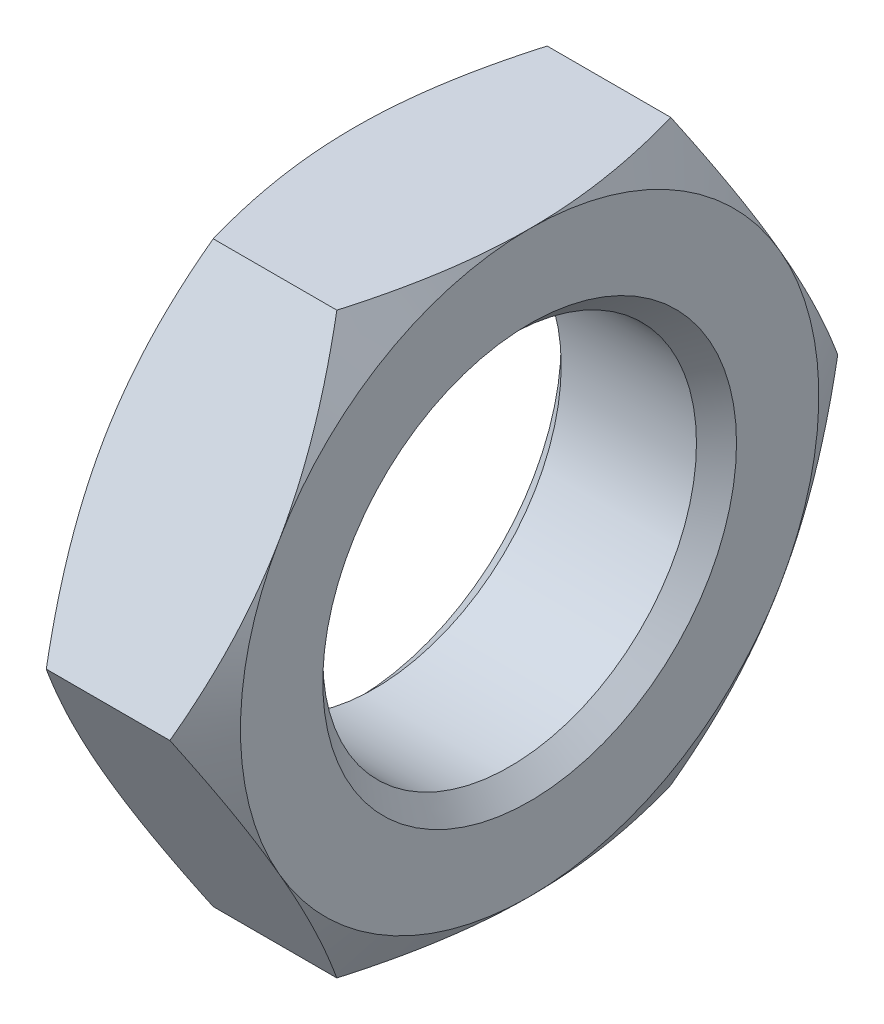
ISO-10303-21;
HEADER;
FILE_DESCRIPTION(('STEP AP214'),'2;1');
FILE_NAME('part.step','',(''),(''),'','','');
FILE_SCHEMA(('AUTOMOTIVE_DESIGN { 1 0 10303 214 1 1 1 1 }'));
ENDSEC;
DATA;
#1=APPLICATION_CONTEXT('core data for automotive mechanical design processes');
#2=APPLICATION_PROTOCOL_DEFINITION('international standard','automotive_design',2000,#1);
#3=PRODUCT_CONTEXT('',#1,'mechanical');
#4=PRODUCT('Part','Part','',(#3));
#5=PRODUCT_RELATED_PRODUCT_CATEGORY('part','',(#4));
#6=PRODUCT_DEFINITION_FORMATION('','',#4);
#7=PRODUCT_DEFINITION_CONTEXT('part definition',#1,'design');
#8=PRODUCT_DEFINITION('design','',#6,#7);
#9=PRODUCT_DEFINITION_SHAPE('','',#8);
#10=(LENGTH_UNIT() NAMED_UNIT(*) SI_UNIT(.MILLI.,.METRE.));
#11=(NAMED_UNIT(*) PLANE_ANGLE_UNIT() SI_UNIT($,.RADIAN.));
#12=(NAMED_UNIT(*) SI_UNIT($,.STERADIAN.) SOLID_ANGLE_UNIT());
#13=UNCERTAINTY_MEASURE_WITH_UNIT(LENGTH_MEASURE(1.E-05),#10,'distance_accuracy_value','');
#14=(GEOMETRIC_REPRESENTATION_CONTEXT(3) GLOBAL_UNCERTAINTY_ASSIGNED_CONTEXT((#13)) GLOBAL_UNIT_ASSIGNED_CONTEXT((#10,
#11,#12)) REPRESENTATION_CONTEXT('',''));
#15=CARTESIAN_POINT('',(0.,0.,0.));
#16=DIRECTION('',(0.,0.,1.));
#17=DIRECTION('',(1.,0.,0.));
#18=AXIS2_PLACEMENT_3D('',#15,#16,#17);
#19=CARTESIAN_POINT('',(19.7,32.5,-18.7638837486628));
#20=DIRECTION('',(1.,0.,0.));
#21=DIRECTION('',(0.,0.,-1.));
#22=AXIS2_PLACEMENT_3D('',#19,#20,#21);
#23=PLANE('',#22);
#24=CARTESIAN_POINT('',(19.7,0.,0.));
#25=DIRECTION('',(1.,0.,0.));
#26=DIRECTION('',(0.,0.,-1.));
#27=AXIS2_PLACEMENT_3D('',#24,#25,#26);
#28=CIRCLE('',#27,23.25);
#29=CARTESIAN_POINT('',(19.7,0.,-23.25));
#30=VERTEX_POINT('',#29);
#31=EDGE_CURVE('E11',#30,#30,#28,.F.);
#32=ORIENTED_EDGE('',*,*,#31,.T.);
#33=EDGE_LOOP('',(#32));
#34=FACE_BOUND('',#33,.T.);
#35=CARTESIAN_POINT('',(19.7,0.,0.));
#36=DIRECTION('',(1.,0.,0.));
#37=DIRECTION('',(0.,0.,-1.));
#38=AXIS2_PLACEMENT_3D('',#35,#36,#37);
#39=CIRCLE('',#38,32.5);
#40=CARTESIAN_POINT('',(19.7,-32.5,0.));
#41=VERTEX_POINT('',#40);
#42=CARTESIAN_POINT('',(19.7,-16.25,-28.1458256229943));
#43=VERTEX_POINT('',#42);
#44=EDGE_CURVE('E142',#41,#43,#39,.T.);
#45=ORIENTED_EDGE('',*,*,#44,.T.);
#46=CARTESIAN_POINT('',(19.7,16.25,-28.1458256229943));
#47=VERTEX_POINT('',#46);
#48=EDGE_CURVE('E130',#43,#47,#39,.T.);
#49=ORIENTED_EDGE('',*,*,#48,.T.);
#50=CARTESIAN_POINT('',(19.7,32.5,0.));
#51=VERTEX_POINT('',#50);
#52=EDGE_CURVE('E144',#47,#51,#39,.T.);
#53=ORIENTED_EDGE('',*,*,#52,.T.);
#54=CARTESIAN_POINT('',(19.7,16.25,28.1458256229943));
#55=VERTEX_POINT('',#54);
#56=EDGE_CURVE('E55',#51,#55,#39,.T.);
#57=ORIENTED_EDGE('',*,*,#56,.T.);
#58=CARTESIAN_POINT('',(19.7,-16.25,28.1458256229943));
#59=VERTEX_POINT('',#58);
#60=EDGE_CURVE('E63',#55,#59,#39,.T.);
#61=ORIENTED_EDGE('',*,*,#60,.T.);
#62=EDGE_CURVE('E166',#59,#41,#39,.T.);
#63=ORIENTED_EDGE('',*,*,#62,.T.);
#64=EDGE_LOOP('',(#45,#49,#53,#57,#61,#63));
#65=FACE_BOUND('',#64,.T.);
#66=ADVANCED_FACE('F39',(#34,#65),#23,.T.);
#67=CARTESIAN_POINT('',(0.,32.5,-18.7638837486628));
#68=DIRECTION('',(1.,0.,0.));
#69=DIRECTION('',(0.,0.,-1.));
#70=AXIS2_PLACEMENT_3D('',#67,#68,#69);
#71=PLANE('',#70);
#72=CARTESIAN_POINT('',(0.,0.,0.));
#73=DIRECTION('',(1.,0.,0.));
#74=DIRECTION('',(0.,0.,-1.));
#75=AXIS2_PLACEMENT_3D('',#72,#73,#74);
#76=CIRCLE('',#75,23.25);
#77=CARTESIAN_POINT('',(0.,0.,-23.25));
#78=VERTEX_POINT('',#77);
#79=EDGE_CURVE('E164',#78,#78,#76,.T.);
#80=ORIENTED_EDGE('',*,*,#79,.T.);
#81=EDGE_LOOP('',(#80));
#82=FACE_BOUND('',#81,.T.);
#83=CARTESIAN_POINT('',(0.,0.,0.));
#84=DIRECTION('',(1.,0.,0.));
#85=DIRECTION('',(0.,0.,-1.));
#86=AXIS2_PLACEMENT_3D('',#83,#84,#85);
#87=CIRCLE('',#86,32.5);
#88=CARTESIAN_POINT('',(0.,-16.25,-28.1458256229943));
#89=VERTEX_POINT('',#88);
#90=CARTESIAN_POINT('',(0.,16.25,-28.1458256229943));
#91=VERTEX_POINT('',#90);
#92=EDGE_CURVE('E173',#89,#91,#87,.T.);
#93=ORIENTED_EDGE('',*,*,#92,.F.);
#94=CARTESIAN_POINT('',(0.,-32.5,0.));
#95=VERTEX_POINT('',#94);
#96=EDGE_CURVE('E316',#95,#89,#87,.T.);
#97=ORIENTED_EDGE('',*,*,#96,.F.);
#98=CARTESIAN_POINT('',(0.,-16.25,28.1458256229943));
#99=VERTEX_POINT('',#98);
#100=EDGE_CURVE('E319',#99,#95,#87,.T.);
#101=ORIENTED_EDGE('',*,*,#100,.F.);
#102=CARTESIAN_POINT('',(0.,16.25,28.1458256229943));
#103=VERTEX_POINT('',#102);
#104=EDGE_CURVE('E326',#103,#99,#87,.T.);
#105=ORIENTED_EDGE('',*,*,#104,.F.);
#106=CARTESIAN_POINT('',(0.,32.5,0.));
#107=VERTEX_POINT('',#106);
#108=EDGE_CURVE('E178',#107,#103,#87,.T.);
#109=ORIENTED_EDGE('',*,*,#108,.F.);
#110=EDGE_CURVE('E174',#91,#107,#87,.T.);
#111=ORIENTED_EDGE('',*,*,#110,.F.);
#112=EDGE_LOOP('',(#93,#97,#101,#105,#109,#111));
#113=FACE_BOUND('',#112,.T.);
#114=ADVANCED_FACE('F317',(#82,#113),#71,.F.);
#115=CARTESIAN_POINT('',(19.7,0.,0.));
#116=DIRECTION('',(-1.,0.,0.));
#117=DIRECTION('',(0.,0.,1.));
#118=AXIS2_PLACEMENT_3D('',#115,#116,#117);
#119=CYLINDRICAL_SURFACE('',#118,21.);
#120=CARTESIAN_POINT('',(2.25000000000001,0.,0.));
#121=DIRECTION('',(1.,0.,0.));
#122=DIRECTION('',(0.,0.,-1.));
#123=AXIS2_PLACEMENT_3D('',#120,#121,#122);
#124=CIRCLE('',#123,21.);
#125=CARTESIAN_POINT('',(2.25000000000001,0.,-21.));
#126=VERTEX_POINT('',#125);
#127=EDGE_CURVE('E48',#126,#126,#124,.F.);
#128=ORIENTED_EDGE('',*,*,#127,.T.);
#129=EDGE_LOOP('',(#128));
#130=FACE_BOUND('',#129,.T.);
#131=CARTESIAN_POINT('',(17.45,0.,0.));
#132=DIRECTION('',(1.,0.,0.));
#133=DIRECTION('',(0.,0.,-1.));
#134=AXIS2_PLACEMENT_3D('',#131,#132,#133);
#135=CIRCLE('',#134,21.);
#136=CARTESIAN_POINT('',(17.45,0.,-21.));
#137=VERTEX_POINT('',#136);
#138=EDGE_CURVE('E388',#137,#137,#135,.T.);
#139=ORIENTED_EDGE('',*,*,#138,.T.);
#140=EDGE_LOOP('',(#139));
#141=FACE_BOUND('',#140,.T.);
#142=ADVANCED_FACE('F234',(#130,#141),#119,.F.);
#143=CARTESIAN_POINT('',(0.,0.,0.));
#144=DIRECTION('',(1.,0.,0.));
#145=DIRECTION('',(0.,0.,-1.));
#146=AXIS2_PLACEMENT_3D('',#143,#144,#145);
#147=CONICAL_SURFACE('',#146,32.5,1.0471975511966);
#148=CARTESIAN_POINT('',(2.90284958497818,-32.5002,-18.763768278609));
#149=CARTESIAN_POINT('',(2.66475598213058,-31.7858647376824,-19.1761899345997));
#150=CARTESIAN_POINT('',(2.4374668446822,-31.0687431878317,-19.5902202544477));
#151=CARTESIAN_POINT('',(2.00750073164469,-29.6287496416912,-20.4216009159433));
#152=CARTESIAN_POINT('',(1.80483185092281,-28.9058758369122,-20.8389523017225));
#153=CARTESIAN_POINT('',(1.42682655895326,-27.4529653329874,-21.677790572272));
#154=CARTESIAN_POINT('',(1.25155541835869,-26.7229158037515,-22.0992848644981));
#155=CARTESIAN_POINT('',(0.932121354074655,-25.2577749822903,-22.9451843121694));
#156=CARTESIAN_POINT('',(0.787955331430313,-24.5226841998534,-23.3695891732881));
#157=CARTESIAN_POINT('',(0.536851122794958,-23.0662503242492,-24.2104616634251));
#158=CARTESIAN_POINT('',(0.429082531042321,-22.3450152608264,-24.6268669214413));
#159=CARTESIAN_POINT('',(0.248379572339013,-20.8992404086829,-25.4615854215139));
#160=CARTESIAN_POINT('',(0.175445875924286,-20.1747005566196,-25.8798987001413));
#161=CARTESIAN_POINT('',(0.066254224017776,-18.7244038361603,-26.7172279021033));
#162=CARTESIAN_POINT('',(0.0299526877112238,-17.9986494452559,-27.1362423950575));
#163=CARTESIAN_POINT('',(-0.00519390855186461,-16.5464708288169,-27.9746581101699));
#164=CARTESIAN_POINT('',(-0.00404012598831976,-15.8200466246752,-28.394059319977));
#165=CARTESIAN_POINT('',(0.0331072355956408,-14.4619904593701,-29.1781334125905));
#166=CARTESIAN_POINT('',(0.064571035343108,-13.8302617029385,-29.5428621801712));
#167=CARTESIAN_POINT('',(0.155228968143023,-12.5683107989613,-30.2714498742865));
#168=CARTESIAN_POINT('',(0.21442270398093,-11.9380886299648,-30.6353088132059));
#169=CARTESIAN_POINT('',(0.359511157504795,-10.6793911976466,-31.3620181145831));
#170=CARTESIAN_POINT('',(0.445430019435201,-10.0509180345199,-31.7248672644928));
#171=CARTESIAN_POINT('',(0.642461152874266,-8.79695895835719,-32.4488408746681));
#172=CARTESIAN_POINT('',(0.753573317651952,-8.1714730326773,-32.8099653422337));
#173=CARTESIAN_POINT('',(1.00194725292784,-6.91020905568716,-33.5381564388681));
#174=CARTESIAN_POINT('',(1.13973212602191,-6.27450860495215,-33.9051782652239));
#175=CARTESIAN_POINT('',(1.437775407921,-5.00699846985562,-34.6369755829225));
#176=CARTESIAN_POINT('',(1.5980368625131,-4.37518932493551,-35.0017507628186));
#177=CARTESIAN_POINT('',(1.93860807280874,-3.1169433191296,-35.7281994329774));
#178=CARTESIAN_POINT('',(2.11887859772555,-2.49049845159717,-36.0898775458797));
#179=CARTESIAN_POINT('',(2.49766949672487,-1.24194155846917,-36.8107322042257));
#180=CARTESIAN_POINT('',(2.69618472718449,-0.61982836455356,-37.1699094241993));
#181=CARTESIAN_POINT('',(2.90284958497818,0.000200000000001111,-37.5278829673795));
#182=B_SPLINE_CURVE_WITH_KNOTS('',3,(#148,#149,#150,#151,#152,#153,#154,#155,#156,#157,#158,
#159,#160,#161,#162,#163,#164,#165,#166,#167,#168,#169,#170,#171,#172,#173,#174,#175,#176,#177,
#178,#179,#180,#181),.UNSPECIFIED.,.F.,.F.,(4,2,2,2,2,2,2,2,2,2,2,2,2,2,2,2,4),(0.,
2.57562469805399,5.15209395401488,7.73461063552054,10.316869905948,12.8354474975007,
15.3540735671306,17.8696997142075,20.3852481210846,22.5751277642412,24.7649760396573,
26.9568084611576,29.1486315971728,31.3888387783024,33.6293498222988,35.865543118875,
38.1011079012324),.UNSPECIFIED.);
#183=CARTESIAN_POINT('',(2.90278291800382,0.,-37.5277674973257));
#184=VERTEX_POINT('',#183);
#185=EDGE_CURVE('E333',#89,#184,#182,.T.);
#186=ORIENTED_EDGE('',*,*,#185,.F.);
#187=ORIENTED_EDGE('',*,*,#92,.T.);
#188=CARTESIAN_POINT('',(2.90284958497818,-0.000199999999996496,-37.5278829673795));
#189=CARTESIAN_POINT('',(2.66475598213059,0.71413526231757,-37.1154613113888));
#190=CARTESIAN_POINT('',(2.43746684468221,1.43125681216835,-36.7014309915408));
#191=CARTESIAN_POINT('',(2.0075007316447,2.87125035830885,-35.8700503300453));
#192=CARTESIAN_POINT('',(1.80483185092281,3.59412416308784,-35.452698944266));
#193=CARTESIAN_POINT('',(1.42682655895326,5.04703466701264,-34.6138606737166));
#194=CARTESIAN_POINT('',(1.25155541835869,5.77708419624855,-34.1923663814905));
#195=CARTESIAN_POINT('',(0.932121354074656,7.24222501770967,-33.3464669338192));
#196=CARTESIAN_POINT('',(0.787955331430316,7.97731580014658,-32.9220620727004));
#197=CARTESIAN_POINT('',(0.536851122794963,9.43374967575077,-32.0811895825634));
#198=CARTESIAN_POINT('',(0.429082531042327,10.1549847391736,-31.6647843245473));
#199=CARTESIAN_POINT('',(0.248379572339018,11.6007595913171,-30.8300658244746));
#200=CARTESIAN_POINT('',(0.175445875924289,12.3252994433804,-30.4117525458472));
#201=CARTESIAN_POINT('',(0.0662542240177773,13.7755961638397,-29.5744233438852));
#202=CARTESIAN_POINT('',(0.0299526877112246,14.5013505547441,-29.1554088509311));
#203=CARTESIAN_POINT('',(-0.0051939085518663,15.9535291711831,-28.3169931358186));
#204=CARTESIAN_POINT('',(-0.00404012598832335,16.6799533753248,-27.8975919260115));
#205=CARTESIAN_POINT('',(0.0331072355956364,18.0380095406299,-27.113517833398));
#206=CARTESIAN_POINT('',(0.0645710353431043,18.6697382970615,-26.7487890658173));
#207=CARTESIAN_POINT('',(0.15522896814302,19.9316892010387,-26.020201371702));
#208=CARTESIAN_POINT('',(0.214422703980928,20.5619113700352,-25.6563424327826));
#209=CARTESIAN_POINT('',(0.359511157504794,21.8206088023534,-24.9296331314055));
#210=CARTESIAN_POINT('',(0.445430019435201,22.4490819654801,-24.5667839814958));
#211=CARTESIAN_POINT('',(0.642461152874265,23.7030410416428,-23.8428103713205));
#212=CARTESIAN_POINT('',(0.753573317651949,24.3285269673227,-23.4816859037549));
#213=CARTESIAN_POINT('',(1.00194725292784,25.5897909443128,-22.7534948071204));
#214=CARTESIAN_POINT('',(1.13973212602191,26.2254913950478,-22.3864729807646));
#215=CARTESIAN_POINT('',(1.437775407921,27.4930015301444,-21.654675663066));
#216=CARTESIAN_POINT('',(1.59803686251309,28.1248106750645,-21.2899004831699));
#217=CARTESIAN_POINT('',(1.93860807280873,29.3830566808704,-20.5634518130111));
#218=CARTESIAN_POINT('',(2.11887859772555,30.0095015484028,-20.2017737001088));
#219=CARTESIAN_POINT('',(2.49766949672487,31.2580584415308,-19.4809190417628));
#220=CARTESIAN_POINT('',(2.69618472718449,31.8801716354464,-19.1217418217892));
#221=CARTESIAN_POINT('',(2.90284958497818,32.5002,-18.763768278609));
#222=B_SPLINE_CURVE_WITH_KNOTS('',3,(#188,#189,#190,#191,#192,#193,#194,#195,#196,#197,#198,
#199,#200,#201,#202,#203,#204,#205,#206,#207,#208,#209,#210,#211,#212,#213,#214,#215,#216,#217,
#218,#219,#220,#221),.UNSPECIFIED.,.F.,.F.,(4,2,2,2,2,2,2,2,2,2,2,2,2,2,2,2,4),(0.,
2.57562469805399,5.15209395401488,7.73461063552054,10.316869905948,12.8354474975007,
15.3540735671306,17.8696997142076,20.3852481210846,22.5751277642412,24.7649760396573,
26.9568084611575,29.1486315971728,31.3888387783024,33.6293498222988,35.865543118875,
38.1011079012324),.UNSPECIFIED.);
#223=EDGE_CURVE('E215',#184,#91,#222,.T.);
#224=ORIENTED_EDGE('',*,*,#223,.F.);
#225=EDGE_LOOP('',(#186,#187,#224));
#226=FACE_BOUND('',#225,.T.);
#227=ADVANCED_FACE('F194',(#226),#147,.T.);
#228=ORIENTED_EDGE('',*,*,#96,.T.);
#229=CARTESIAN_POINT('',(2.90278291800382,-32.5,-18.7638837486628));
#230=VERTEX_POINT('',#229);
#231=EDGE_CURVE('E156',#230,#89,#182,.T.);
#232=ORIENTED_EDGE('',*,*,#231,.F.);
#233=CARTESIAN_POINT('',(16.0223922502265,-32.5,-50.7346527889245));
#234=CARTESIAN_POINT('',(15.6766902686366,-32.5,-50.0235396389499));
#235=CARTESIAN_POINT('',(15.3326823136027,-32.5,-49.3116005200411));
#236=CARTESIAN_POINT('',(14.6484482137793,-32.5,-47.8858991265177));
#237=CARTESIAN_POINT('',(14.3082221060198,-32.5,-47.1721368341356));
#238=CARTESIAN_POINT('',(13.6319012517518,-32.5,-45.7425240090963));
#239=CARTESIAN_POINT('',(13.2958071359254,-32.5,-45.0266731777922));
#240=CARTESIAN_POINT('',(12.6282762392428,-32.5,-43.5928062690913));
#241=CARTESIAN_POINT('',(12.296839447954,-32.5,-42.8747901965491));
#242=CARTESIAN_POINT('',(11.3067802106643,-32.5,-40.7095263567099));
#243=CARTESIAN_POINT('',(10.6560201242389,-32.5,-39.2586687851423));
#244=CARTESIAN_POINT('',(9.38065257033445,-32.5,-36.3455263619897));
#245=CARTESIAN_POINT('',(8.75604388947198,-32.5,-34.8832420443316));
#246=CARTESIAN_POINT('',(7.83396474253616,-32.5,-32.6552529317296));
#247=CARTESIAN_POINT('',(7.52433268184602,-32.5,-31.8945767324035));
#248=CARTESIAN_POINT('',(6.91512538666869,-32.5,-30.3691976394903));
#249=CARTESIAN_POINT('',(6.61555017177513,-32.5,-29.6044947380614));
#250=CARTESIAN_POINT('',(6.02778171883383,-32.5,-28.0706094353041));
#251=CARTESIAN_POINT('',(5.73958991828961,-32.5,-27.3014264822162));
#252=CARTESIAN_POINT('',(5.17620255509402,-32.5,-25.7583087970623));
#253=CARTESIAN_POINT('',(4.90100694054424,-32.5,-24.9843740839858));
#254=CARTESIAN_POINT('',(4.36594272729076,-32.5,-23.4329437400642));
#255=CARTESIAN_POINT('',(4.10604457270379,-32.5,-22.6554583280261));
#256=CARTESIAN_POINT('',(3.6030001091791,-32.5,-21.0950562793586));
#257=CARTESIAN_POINT('',(3.35985408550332,-32.5,-20.3121395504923));
#258=CARTESIAN_POINT('',(2.89264525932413,-32.5,-18.7408410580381));
#259=CARTESIAN_POINT('',(2.66857736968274,-32.5,-17.9524608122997));
#260=CARTESIAN_POINT('',(2.24194407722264,-32.5,-16.3699095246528));
#261=CARTESIAN_POINT('',(2.03937792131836,-32.5,-15.5757386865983));
#262=CARTESIAN_POINT('',(1.65947183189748,-32.5,-13.9860935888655));
#263=CARTESIAN_POINT('',(1.4819960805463,-32.5,-13.1906519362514));
#264=CARTESIAN_POINT('',(1.15362467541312,-32.5,-11.5942884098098));
#265=CARTESIAN_POINT('',(1.00272849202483,-32.5,-10.7933666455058));
#266=CARTESIAN_POINT('',(0.730161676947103,-32.5,-9.18656631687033));
#267=CARTESIAN_POINT('',(0.608489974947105,-32.5,-8.3806879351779));
#268=CARTESIAN_POINT('',(0.396778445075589,-32.5,-6.76475926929));
#269=CARTESIAN_POINT('',(0.306738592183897,-32.5,-5.95470898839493));
#270=CARTESIAN_POINT('',(0.161234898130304,-32.5,-4.34233501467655));
#271=CARTESIAN_POINT('',(0.105327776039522,-32.5,-3.54005156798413));
#272=CARTESIAN_POINT('',(0.0275095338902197,-32.5,-1.93383766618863));
#273=CARTESIAN_POINT('',(0.00559784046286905,-32.5,-1.12990723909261));
#274=CARTESIAN_POINT('',(-0.00371135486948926,-32.5,0.478152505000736));
#275=CARTESIAN_POINT('',(0.00889119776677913,-32.5,1.28228182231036));
#276=CARTESIAN_POINT('',(0.0683153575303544,-32.5,2.88931505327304));
#277=CARTESIAN_POINT('',(0.115138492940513,-32.5,3.69221891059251));
#278=CARTESIAN_POINT('',(0.222724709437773,-32.5,5.05280465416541));
#279=CARTESIAN_POINT('',(0.274983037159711,-32.5,5.61117662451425));
#280=CARTESIAN_POINT('',(0.395033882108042,-32.5,6.72625434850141));
#281=CARTESIAN_POINT('',(0.462826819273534,-32.5,7.28296005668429));
#282=CARTESIAN_POINT('',(0.68852348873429,-32.5,8.95013565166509));
#283=CARTESIAN_POINT('',(0.868743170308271,-32.5,10.0576405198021));
#284=CARTESIAN_POINT('',(1.28231729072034,-32.5,12.2633847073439));
#285=CARTESIAN_POINT('',(1.51571217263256,-32.5,13.3616163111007));
#286=CARTESIAN_POINT('',(2.02848699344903,-32.5,15.5471944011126));
#287=CARTESIAN_POINT('',(2.307866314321,-32.5,16.6345410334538));
#288=CARTESIAN_POINT('',(2.91245141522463,-32.5,18.8224305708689));
#289=CARTESIAN_POINT('',(3.23853937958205,-32.5,19.9227278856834));
#290=CARTESIAN_POINT('',(3.92507692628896,-32.5,22.1124878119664));
#291=CARTESIAN_POINT('',(4.28552673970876,-32.5,23.2019503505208));
#292=CARTESIAN_POINT('',(5.03500811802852,-32.5,25.3705758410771));
#293=CARTESIAN_POINT('',(5.42403063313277,-32.5,26.4497419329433));
#294=CARTESIAN_POINT('',(6.02551832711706,-32.5,28.0617379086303));
#295=CARTESIAN_POINT('',(6.2290064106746,-32.5,28.5979440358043));
#296=CARTESIAN_POINT('',(6.64146951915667,-32.5,29.6682453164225));
#297=CARTESIAN_POINT('',(6.85044456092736,-32.5,30.2023404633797));
#298=CARTESIAN_POINT('',(7.35911083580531,-32.5,31.4845824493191));
#299=CARTESIAN_POINT('',(7.66124519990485,-32.5,32.2317601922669));
#300=CARTESIAN_POINT('',(8.27426777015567,-32.5,33.7225199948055));
#301=CARTESIAN_POINT('',(8.58515609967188,-32.5,34.4661020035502));
#302=CARTESIAN_POINT('',(9.52944603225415,-32.5,36.6919984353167));
#303=CARTESIAN_POINT('',(10.1744465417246,-32.5,38.1693981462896));
#304=CARTESIAN_POINT('',(11.4889910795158,-32.5,41.1136157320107));
#305=CARTESIAN_POINT('',(12.1585410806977,-32.5,42.5804309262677));
#306=CARTESIAN_POINT('',(13.517152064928,-32.5,45.5049385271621));
#307=CARTESIAN_POINT('',(14.2062125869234,-32.5,46.9626311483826));
#308=CARTESIAN_POINT('',(15.6009338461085,-32.5,49.8721348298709));
#309=CARTESIAN_POINT('',(16.306613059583,-32.5,51.3239370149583));
#310=CARTESIAN_POINT('',(17.7309088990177,-32.5,54.2211811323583));
#311=CARTESIAN_POINT('',(18.4495255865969,-32.5,55.6666230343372));
#312=CARTESIAN_POINT('',(19.8973411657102,-32.5,58.5519409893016));
#313=CARTESIAN_POINT('',(20.6265385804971,-32.5,59.9918177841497));
#314=CARTESIAN_POINT('',(22.0938380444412,-32.5,62.8670195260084));
#315=CARTESIAN_POINT('',(22.8319400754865,-32.5,64.3023444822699));
#316=CARTESIAN_POINT('',(24.2514256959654,-32.5,67.0450372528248));
#317=CARTESIAN_POINT('',(24.9321884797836,-32.5,68.3527266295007));
#318=CARTESIAN_POINT('',(26.2990991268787,-32.5,70.9652893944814));
#319=CARTESIAN_POINT('',(26.9852469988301,-32.5,72.2701627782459));
#320=CARTESIAN_POINT('',(28.362229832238,-32.5,74.8774944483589));
#321=CARTESIAN_POINT('',(29.0530649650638,-32.5,76.1799526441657));
#322=CARTESIAN_POINT('',(30.4387973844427,-32.5,78.7827064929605));
#323=CARTESIAN_POINT('',(31.1336946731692,-32.5,80.083002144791));
#324=CARTESIAN_POINT('',(32.5252094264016,-32.5,82.678257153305));
#325=CARTESIAN_POINT('',(33.2218175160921,-32.5,83.9732215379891));
#326=CARTESIAN_POINT('',(34.6181524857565,-32.5,86.5614679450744));
#327=CARTESIAN_POINT('',(35.3178793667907,-32.5,87.8547499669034));
#328=CARTESIAN_POINT('',(36.7200502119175,-32.5,90.4397421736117));
#329=CARTESIAN_POINT('',(37.4224940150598,-32.5,91.7314524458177));
#330=CARTESIAN_POINT('',(38.8298413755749,-32.5,94.3135298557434));
#331=CARTESIAN_POINT('',(39.5347449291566,-32.5,95.6038969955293));
#332=CARTESIAN_POINT('',(40.2407304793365,-32.5,96.8936711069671));
#333=B_SPLINE_CURVE_WITH_KNOTS('',3,(#233,#234,#235,#236,#237,#238,#239,#240,#241,#242,#243,
#244,#245,#246,#247,#248,#249,#250,#251,#252,#253,#254,#255,#256,#257,#258,#259,#260,#261,#262,
#263,#264,#265,#266,#267,#268,#269,#270,#271,#272,#273,#274,#275,#276,#277,#278,#279,#280,#281,
#282,#283,#284,#285,#286,#287,#288,#289,#290,#291,#292,#293,#294,#295,#296,#297,#298,#299,#300,
#301,#302,#303,#304,#305,#306,#307,#308,#309,#310,#311,#312,#313,#314,#315,#316,#317,#318,#319,
#320,#321,#322,#323,#324,#325,#326,#327,#328,#329,#330,#331,#332),.UNSPECIFIED.,.F.,.F.,(4,2,2,
2,2,2,2,2,2,2,2,2,2,2,2,2,2,2,2,2,2,2,2,2,2,2,2,2,2,2,2,2,2,2,2,2,2,2,2,2,2,2,2,2,2,2,2,2,2,4),
(0.,2.37207294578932,4.74416909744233,7.11662292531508,9.48907143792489,14.2592250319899,
19.0291570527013,21.4929379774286,23.9567237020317,26.4208195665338,28.8849055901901,
31.3440629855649,33.8032622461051,36.2618037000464,38.7202590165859,41.164850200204,
43.609392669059,46.0538455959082,48.4982965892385,50.9102859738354,53.3222346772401,
55.7341871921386,58.1462474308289,59.8284705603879,61.5107391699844,64.875346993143,
68.2425224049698,71.6096525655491,75.0517876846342,78.4939459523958,81.9350186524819,
83.6555528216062,85.3760922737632,87.793883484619,90.2117087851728,95.0475697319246,
99.8846151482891,104.721546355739,109.564135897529,114.406748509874,119.248691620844,
124.090624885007,128.513438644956,132.936259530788,137.359242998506,141.782228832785,
146.193545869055,150.604864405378,155.015925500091,159.426979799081),.UNSPECIFIED.);
#334=EDGE_CURVE('E177',#95,#230,#333,.F.);
#335=ORIENTED_EDGE('',*,*,#334,.F.);
#336=EDGE_LOOP('',(#228,#232,#335));
#337=FACE_BOUND('',#336,.T.);
#338=ADVANCED_FACE('F349',(#337),#147,.T.);
#339=CARTESIAN_POINT('',(9.85,0.,0.));
#340=DIRECTION('',(-1.,0.,0.));
#341=DIRECTION('',(0.,0.,1.));
#342=AXIS2_PLACEMENT_3D('',#339,#340,#341);
#343=CONICAL_SURFACE('',#342,49.5607004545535,1.0471975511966);
#344=CARTESIAN_POINT('',(16.7971504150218,0.000200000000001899,-37.5278829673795));
#345=CARTESIAN_POINT('',(17.0352440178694,-0.714135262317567,-37.1154613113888));
#346=CARTESIAN_POINT('',(17.2625331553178,-1.43125681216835,-36.7014309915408));
#347=CARTESIAN_POINT('',(17.6924992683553,-2.87125035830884,-35.8700503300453));
#348=CARTESIAN_POINT('',(17.8951681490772,-3.59412416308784,-35.452698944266));
#349=CARTESIAN_POINT('',(18.2731734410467,-5.04703466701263,-34.6138606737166));
#350=CARTESIAN_POINT('',(18.4484445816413,-5.77708419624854,-34.1923663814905));
#351=CARTESIAN_POINT('',(18.7678786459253,-7.24222501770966,-33.3464669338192));
#352=CARTESIAN_POINT('',(18.9120446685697,-7.97731580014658,-32.9220620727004));
#353=CARTESIAN_POINT('',(19.163148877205,-9.43374967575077,-32.0811895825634));
#354=CARTESIAN_POINT('',(19.2709174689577,-10.1549847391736,-31.6647843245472));
#355=CARTESIAN_POINT('',(19.451620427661,-11.6007595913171,-30.8300658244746));
#356=CARTESIAN_POINT('',(19.5245541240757,-12.3252994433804,-30.4117525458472));
#357=CARTESIAN_POINT('',(19.6337457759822,-13.7755961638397,-29.5744233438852));
#358=CARTESIAN_POINT('',(19.6700473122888,-14.5013505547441,-29.1554088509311));
#359=CARTESIAN_POINT('',(19.7051939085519,-15.9535291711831,-28.3169931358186));
#360=CARTESIAN_POINT('',(19.7040401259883,-16.6799533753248,-27.8975919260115));
#361=CARTESIAN_POINT('',(19.6668927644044,-18.0380095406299,-27.113517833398));
#362=CARTESIAN_POINT('',(19.6354289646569,-18.6697382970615,-26.7487890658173));
#363=CARTESIAN_POINT('',(19.544771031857,-19.9316892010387,-26.020201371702));
#364=CARTESIAN_POINT('',(19.4855772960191,-20.5619113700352,-25.6563424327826));
#365=CARTESIAN_POINT('',(19.3404888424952,-21.8206088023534,-24.9296331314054));
#366=CARTESIAN_POINT('',(19.2545699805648,-22.4490819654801,-24.5667839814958));
#367=CARTESIAN_POINT('',(19.0575388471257,-23.7030410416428,-23.8428103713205));
#368=CARTESIAN_POINT('',(18.946426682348,-24.3285269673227,-23.4816859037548));
#369=CARTESIAN_POINT('',(18.6980527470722,-25.5897909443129,-22.7534948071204));
#370=CARTESIAN_POINT('',(18.5602678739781,-26.2254913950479,-22.3864729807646));
#371=CARTESIAN_POINT('',(18.262224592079,-27.4930015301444,-21.654675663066));
#372=CARTESIAN_POINT('',(18.1019631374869,-28.1248106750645,-21.2899004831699));
#373=CARTESIAN_POINT('',(17.7613919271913,-29.3830566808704,-20.5634518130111));
#374=CARTESIAN_POINT('',(17.5811214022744,-30.0095015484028,-20.2017737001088));
#375=CARTESIAN_POINT('',(17.2023305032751,-31.2580584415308,-19.4809190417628));
#376=CARTESIAN_POINT('',(17.0038152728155,-31.8801716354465,-19.1217418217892));
#377=CARTESIAN_POINT('',(16.7971504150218,-32.5002,-18.763768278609));
#378=B_SPLINE_CURVE_WITH_KNOTS('',3,(#344,#345,#346,#347,#348,#349,#350,#351,#352,#353,#354,
#355,#356,#357,#358,#359,#360,#361,#362,#363,#364,#365,#366,#367,#368,#369,#370,#371,#372,#373,
#374,#375,#376,#377),.UNSPECIFIED.,.F.,.F.,(4,2,2,2,2,2,2,2,2,2,2,2,2,2,2,2,4),(0.,
2.57562469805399,5.15209395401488,7.73461063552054,10.316869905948,12.8354474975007,
15.3540735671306,17.8696997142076,20.3852481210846,22.5751277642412,24.7649760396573,
26.9568084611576,29.1486315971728,31.3888387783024,33.6293498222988,35.865543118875,
38.1011079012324),.UNSPECIFIED.);
#379=CARTESIAN_POINT('',(16.7972170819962,-32.5,-18.7638837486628));
#380=VERTEX_POINT('',#379);
#381=EDGE_CURVE('E147',#43,#380,#378,.T.);
#382=ORIENTED_EDGE('',*,*,#381,.F.);
#383=ORIENTED_EDGE('',*,*,#44,.F.);
#384=CARTESIAN_POINT('',(3.67760774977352,-32.5,-50.7346527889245));
#385=CARTESIAN_POINT('',(4.02330973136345,-32.5,-50.0235396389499));
#386=CARTESIAN_POINT('',(4.36731768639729,-32.5,-49.3116005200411));
#387=CARTESIAN_POINT('',(5.05155178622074,-32.5,-47.8858991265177));
#388=CARTESIAN_POINT('',(5.39177789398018,-32.5,-47.1721368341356));
#389=CARTESIAN_POINT('',(6.06809874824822,-32.5,-45.7425240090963));
#390=CARTESIAN_POINT('',(6.40419286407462,-32.5,-45.0266731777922));
#391=CARTESIAN_POINT('',(7.07172376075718,-32.5,-43.5928062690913));
#392=CARTESIAN_POINT('',(7.40316055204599,-32.5,-42.8747901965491));
#393=CARTESIAN_POINT('',(8.39321978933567,-32.5,-40.7095263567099));
#394=CARTESIAN_POINT('',(9.04397987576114,-32.5,-39.2586687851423));
#395=CARTESIAN_POINT('',(10.3193474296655,-32.5,-36.3455263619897));
#396=CARTESIAN_POINT('',(10.943956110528,-32.5,-34.8832420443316));
#397=CARTESIAN_POINT('',(11.8660352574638,-32.5,-32.6552529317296));
#398=CARTESIAN_POINT('',(12.175667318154,-32.5,-31.8945767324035));
#399=CARTESIAN_POINT('',(12.7848746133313,-32.5,-30.3691976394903));
#400=CARTESIAN_POINT('',(13.0844498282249,-32.5,-29.6044947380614));
#401=CARTESIAN_POINT('',(13.6722182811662,-32.5,-28.0706094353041));
#402=CARTESIAN_POINT('',(13.9604100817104,-32.5,-27.3014264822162));
#403=CARTESIAN_POINT('',(14.523797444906,-32.5,-25.7583087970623));
#404=CARTESIAN_POINT('',(14.7989930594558,-32.5,-24.9843740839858));
#405=CARTESIAN_POINT('',(15.3340572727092,-32.5,-23.4329437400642));
#406=CARTESIAN_POINT('',(15.5939554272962,-32.5,-22.6554583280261));
#407=CARTESIAN_POINT('',(16.0969998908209,-32.5,-21.0950562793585));
#408=CARTESIAN_POINT('',(16.3401459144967,-32.5,-20.3121395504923));
#409=CARTESIAN_POINT('',(16.8073547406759,-32.5,-18.7408410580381));
#410=CARTESIAN_POINT('',(17.0314226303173,-32.5,-17.9524608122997));
#411=CARTESIAN_POINT('',(17.4580559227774,-32.5,-16.3699095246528));
#412=CARTESIAN_POINT('',(17.6606220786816,-32.5,-15.5757386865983));
#413=CARTESIAN_POINT('',(18.0405281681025,-32.5,-13.9860935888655));
#414=CARTESIAN_POINT('',(18.2180039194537,-32.5,-13.1906519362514));
#415=CARTESIAN_POINT('',(18.5463753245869,-32.5,-11.5942884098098));
#416=CARTESIAN_POINT('',(18.6972715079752,-32.5,-10.7933666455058));
#417=CARTESIAN_POINT('',(18.9698383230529,-32.5,-9.18656631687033));
#418=CARTESIAN_POINT('',(19.0915100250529,-32.5,-8.3806879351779));
#419=CARTESIAN_POINT('',(19.3032215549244,-32.5,-6.76475926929));
#420=CARTESIAN_POINT('',(19.3932614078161,-32.5,-5.95470898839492));
#421=CARTESIAN_POINT('',(19.5387651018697,-32.5,-4.34233501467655));
#422=CARTESIAN_POINT('',(19.5946722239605,-32.5,-3.54005156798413));
#423=CARTESIAN_POINT('',(19.6724904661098,-32.5,-1.93383766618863));
#424=CARTESIAN_POINT('',(19.6944021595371,-32.5,-1.12990723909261));
#425=CARTESIAN_POINT('',(19.7037113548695,-32.5,0.478152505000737));
#426=CARTESIAN_POINT('',(19.6911088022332,-32.5,1.28228182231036));
#427=CARTESIAN_POINT('',(19.6316846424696,-32.5,2.88931505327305));
#428=CARTESIAN_POINT('',(19.5848615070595,-32.5,3.69221891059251));
#429=CARTESIAN_POINT('',(19.4772752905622,-32.5,5.05280465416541));
#430=CARTESIAN_POINT('',(19.4250169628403,-32.5,5.61117662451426));
#431=CARTESIAN_POINT('',(19.304966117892,-32.5,6.72625434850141));
#432=CARTESIAN_POINT('',(19.2371731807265,-32.5,7.2829600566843));
#433=CARTESIAN_POINT('',(19.0114765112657,-32.5,8.9501356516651));
#434=CARTESIAN_POINT('',(18.8312568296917,-32.5,10.0576405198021));
#435=CARTESIAN_POINT('',(18.4176827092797,-32.5,12.2633847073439));
#436=CARTESIAN_POINT('',(18.1842878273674,-32.5,13.3616163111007));
#437=CARTESIAN_POINT('',(17.671513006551,-32.5,15.5471944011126));
#438=CARTESIAN_POINT('',(17.392133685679,-32.5,16.6345410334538));
#439=CARTESIAN_POINT('',(16.7875485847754,-32.5,18.8224305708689));
#440=CARTESIAN_POINT('',(16.4614606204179,-32.5,19.9227278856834));
#441=CARTESIAN_POINT('',(15.774923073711,-32.5,22.1124878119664));
#442=CARTESIAN_POINT('',(15.4144732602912,-32.5,23.2019503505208));
#443=CARTESIAN_POINT('',(14.6649918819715,-32.5,25.3705758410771));
#444=CARTESIAN_POINT('',(14.2759693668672,-32.5,26.4497419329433));
#445=CARTESIAN_POINT('',(13.6744816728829,-32.5,28.0617379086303));
#446=CARTESIAN_POINT('',(13.4709935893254,-32.5,28.5979440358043));
#447=CARTESIAN_POINT('',(13.0585304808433,-32.5,29.6682453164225));
#448=CARTESIAN_POINT('',(12.8495554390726,-32.5,30.2023404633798));
#449=CARTESIAN_POINT('',(12.3408891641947,-32.5,31.4845824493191));
#450=CARTESIAN_POINT('',(12.0387548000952,-32.5,32.2317601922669));
#451=CARTESIAN_POINT('',(11.4257322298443,-32.5,33.7225199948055));
#452=CARTESIAN_POINT('',(11.1148439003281,-32.5,34.4661020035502));
#453=CARTESIAN_POINT('',(10.1705539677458,-32.5,36.6919984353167));
#454=CARTESIAN_POINT('',(9.52555345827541,-32.5,38.1693981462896));
#455=CARTESIAN_POINT('',(8.21100892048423,-32.5,41.1136157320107));
#456=CARTESIAN_POINT('',(7.54145891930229,-32.5,42.5804309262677));
#457=CARTESIAN_POINT('',(6.18284793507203,-32.5,45.5049385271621));
#458=CARTESIAN_POINT('',(5.49378741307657,-32.5,46.9626311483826));
#459=CARTESIAN_POINT('',(4.09906615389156,-32.5,49.8721348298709));
#460=CARTESIAN_POINT('',(3.39338694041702,-32.5,51.3239370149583));
#461=CARTESIAN_POINT('',(1.96909110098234,-32.5,54.2211811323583));
#462=CARTESIAN_POINT('',(1.25047441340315,-32.5,55.6666230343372));
#463=CARTESIAN_POINT('',(-0.197341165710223,-32.5,58.5519409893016));
#464=CARTESIAN_POINT('',(-0.926538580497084,-32.5,59.9918177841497));
#465=CARTESIAN_POINT('',(-2.39383804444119,-32.5,62.8670195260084));
#466=CARTESIAN_POINT('',(-3.13194007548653,-32.5,64.3023444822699));
#467=CARTESIAN_POINT('',(-4.55142569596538,-32.5,67.0450372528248));
#468=CARTESIAN_POINT('',(-5.2321884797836,-32.5,68.3527266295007));
#469=CARTESIAN_POINT('',(-6.59909912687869,-32.5,70.9652893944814));
#470=CARTESIAN_POINT('',(-7.28524699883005,-32.5,72.2701627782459));
#471=CARTESIAN_POINT('',(-8.66222983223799,-32.5,74.8774944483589));
#472=CARTESIAN_POINT('',(-9.35306496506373,-32.5,76.1799526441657));
#473=CARTESIAN_POINT('',(-10.7387973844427,-32.5,78.7827064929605));
#474=CARTESIAN_POINT('',(-11.4336946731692,-32.5,80.0830021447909));
#475=CARTESIAN_POINT('',(-12.8252094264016,-32.5,82.678257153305));
#476=CARTESIAN_POINT('',(-13.5218175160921,-32.5,83.9732215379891));
#477=CARTESIAN_POINT('',(-14.9181524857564,-32.5,86.5614679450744));
#478=CARTESIAN_POINT('',(-15.6178793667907,-32.5,87.8547499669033));
#479=CARTESIAN_POINT('',(-17.0200502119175,-32.5,90.4397421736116));
#480=CARTESIAN_POINT('',(-17.7224940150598,-32.5,91.7314524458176));
#481=CARTESIAN_POINT('',(-19.1298413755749,-32.5,94.3135298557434));
#482=CARTESIAN_POINT('',(-19.8347449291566,-32.5,95.6038969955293));
#483=CARTESIAN_POINT('',(-20.5407304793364,-32.5,96.8936711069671));
#484=B_SPLINE_CURVE_WITH_KNOTS('',3,(#384,#385,#386,#387,#388,#389,#390,#391,#392,#393,#394,
#395,#396,#397,#398,#399,#400,#401,#402,#403,#404,#405,#406,#407,#408,#409,#410,#411,#412,#413,
#414,#415,#416,#417,#418,#419,#420,#421,#422,#423,#424,#425,#426,#427,#428,#429,#430,#431,#432,
#433,#434,#435,#436,#437,#438,#439,#440,#441,#442,#443,#444,#445,#446,#447,#448,#449,#450,#451,
#452,#453,#454,#455,#456,#457,#458,#459,#460,#461,#462,#463,#464,#465,#466,#467,#468,#469,#470,
#471,#472,#473,#474,#475,#476,#477,#478,#479,#480,#481,#482,#483),.UNSPECIFIED.,.F.,.F.,(4,2,2,
2,2,2,2,2,2,2,2,2,2,2,2,2,2,2,2,2,2,2,2,2,2,2,2,2,2,2,2,2,2,2,2,2,2,2,2,2,2,2,2,2,2,2,2,2,2,4),
(0.,2.37207294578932,4.74416909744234,7.11662292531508,9.4890714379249,14.2592250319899,
19.0291570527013,21.4929379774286,23.9567237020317,26.4208195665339,28.8849055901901,
31.3440629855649,33.8032622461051,36.2618037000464,38.7202590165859,41.164850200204,
43.609392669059,46.0538455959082,48.4982965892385,50.9102859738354,53.3222346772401,
55.7341871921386,58.1462474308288,59.8284705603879,61.5107391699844,64.875346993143,
68.2425224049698,71.6096525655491,75.0517876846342,78.4939459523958,81.9350186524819,
83.6555528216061,85.3760922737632,87.793883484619,90.2117087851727,95.0475697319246,
99.8846151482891,104.721546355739,109.564135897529,114.406748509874,119.248691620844,
124.090624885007,128.513438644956,132.936259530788,137.359242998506,141.782228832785,
146.193545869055,150.604864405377,155.015925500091,159.426979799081),.UNSPECIFIED.);
#485=EDGE_CURVE('E151',#380,#41,#484,.T.);
#486=ORIENTED_EDGE('',*,*,#485,.F.);
#487=EDGE_LOOP('',(#382,#383,#486));
#488=FACE_BOUND('',#487,.T.);
#489=ADVANCED_FACE('F148',(#488),#343,.T.);
#490=ORIENTED_EDGE('',*,*,#48,.F.);
#491=CARTESIAN_POINT('',(16.7972170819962,0.,-37.5277674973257));
#492=VERTEX_POINT('',#491);
#493=EDGE_CURVE('E134',#492,#43,#378,.T.);
#494=ORIENTED_EDGE('',*,*,#493,.F.);
#495=CARTESIAN_POINT('',(16.7971504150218,32.5002,-18.763768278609));
#496=CARTESIAN_POINT('',(17.0352440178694,31.7858647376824,-19.1761899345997));
#497=CARTESIAN_POINT('',(17.2625331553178,31.0687431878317,-19.5902202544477));
#498=CARTESIAN_POINT('',(17.6924992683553,29.6287496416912,-20.4216009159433));
#499=CARTESIAN_POINT('',(17.8951681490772,28.9058758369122,-20.8389523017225));
#500=CARTESIAN_POINT('',(18.2731734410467,27.4529653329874,-21.677790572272));
#501=CARTESIAN_POINT('',(18.4484445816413,26.7229158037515,-22.0992848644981));
#502=CARTESIAN_POINT('',(18.7678786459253,25.2577749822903,-22.9451843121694));
#503=CARTESIAN_POINT('',(18.9120446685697,24.5226841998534,-23.3695891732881));
#504=CARTESIAN_POINT('',(19.163148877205,23.0662503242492,-24.2104616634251));
#505=CARTESIAN_POINT('',(19.2709174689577,22.3450152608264,-24.6268669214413));
#506=CARTESIAN_POINT('',(19.451620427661,20.8992404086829,-25.4615854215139));
#507=CARTESIAN_POINT('',(19.5245541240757,20.1747005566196,-25.8798987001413));
#508=CARTESIAN_POINT('',(19.6337457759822,18.7244038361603,-26.7172279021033));
#509=CARTESIAN_POINT('',(19.6700473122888,17.9986494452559,-27.1362423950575));
#510=CARTESIAN_POINT('',(19.7051939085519,16.5464708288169,-27.9746581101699));
#511=CARTESIAN_POINT('',(19.7040401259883,15.8200466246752,-28.394059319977));
#512=CARTESIAN_POINT('',(19.6668927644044,14.4619904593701,-29.1781334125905));
#513=CARTESIAN_POINT('',(19.6354289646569,13.8302617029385,-29.5428621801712));
#514=CARTESIAN_POINT('',(19.544771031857,12.5683107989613,-30.2714498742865));
#515=CARTESIAN_POINT('',(19.4855772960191,11.9380886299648,-30.6353088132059));
#516=CARTESIAN_POINT('',(19.3404888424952,10.6793911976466,-31.3620181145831));
#517=CARTESIAN_POINT('',(19.2545699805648,10.0509180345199,-31.7248672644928));
#518=CARTESIAN_POINT('',(19.0575388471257,8.79695895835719,-32.4488408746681));
#519=CARTESIAN_POINT('',(18.946426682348,8.1714730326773,-32.8099653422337));
#520=CARTESIAN_POINT('',(18.6980527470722,6.91020905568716,-33.5381564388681));
#521=CARTESIAN_POINT('',(18.5602678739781,6.27450860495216,-33.9051782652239));
#522=CARTESIAN_POINT('',(18.262224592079,5.00699846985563,-34.6369755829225));
#523=CARTESIAN_POINT('',(18.1019631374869,4.37518932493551,-35.0017507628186));
#524=CARTESIAN_POINT('',(17.7613919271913,3.1169433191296,-35.7281994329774));
#525=CARTESIAN_POINT('',(17.5811214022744,2.49049845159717,-36.0898775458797));
#526=CARTESIAN_POINT('',(17.2023305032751,1.24194155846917,-36.8107322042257));
#527=CARTESIAN_POINT('',(17.0038152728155,0.619828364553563,-37.1699094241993));
#528=CARTESIAN_POINT('',(16.7971504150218,-0.000199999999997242,-37.5278829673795));
#529=B_SPLINE_CURVE_WITH_KNOTS('',3,(#495,#496,#497,#498,#499,#500,#501,#502,#503,#504,#505,
#506,#507,#508,#509,#510,#511,#512,#513,#514,#515,#516,#517,#518,#519,#520,#521,#522,#523,#524,
#525,#526,#527,#528),.UNSPECIFIED.,.F.,.F.,(4,2,2,2,2,2,2,2,2,2,2,2,2,2,2,2,4),(0.,
2.57562469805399,5.15209395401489,7.73461063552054,10.316869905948,12.8354474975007,
15.3540735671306,17.8696997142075,20.3852481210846,22.5751277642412,24.7649760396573,
26.9568084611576,29.1486315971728,31.3888387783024,33.6293498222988,35.865543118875,
38.1011079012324),.UNSPECIFIED.);
#530=EDGE_CURVE('E136',#47,#492,#529,.T.);
#531=ORIENTED_EDGE('',*,*,#530,.F.);
#532=EDGE_LOOP('',(#490,#494,#531));
#533=FACE_BOUND('',#532,.T.);
#534=ADVANCED_FACE('F132',(#533),#343,.T.);
#535=ORIENTED_EDGE('',*,*,#100,.T.);
#536=CARTESIAN_POINT('',(2.90278291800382,-32.5,18.7638837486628));
#537=VERTEX_POINT('',#536);
#538=EDGE_CURVE('E187',#537,#95,#333,.F.);
#539=ORIENTED_EDGE('',*,*,#538,.F.);
#540=CARTESIAN_POINT('',(2.90284958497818,0.000200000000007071,37.5278829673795));
#541=CARTESIAN_POINT('',(2.66475598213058,-0.714135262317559,37.1154613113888));
#542=CARTESIAN_POINT('',(2.4374668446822,-1.43125681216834,36.7014309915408));
#543=CARTESIAN_POINT('',(2.0075007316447,-2.87125035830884,35.8700503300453));
#544=CARTESIAN_POINT('',(1.80483185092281,-3.59412416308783,35.452698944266));
#545=CARTESIAN_POINT('',(1.42682655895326,-5.04703466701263,34.6138606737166));
#546=CARTESIAN_POINT('',(1.25155541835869,-5.77708419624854,34.1923663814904));
#547=CARTESIAN_POINT('',(0.932121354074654,-7.24222501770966,33.3464669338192));
#548=CARTESIAN_POINT('',(0.787955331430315,-7.97731580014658,32.9220620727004));
#549=CARTESIAN_POINT('',(0.536851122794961,-9.43374967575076,32.0811895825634));
#550=CARTESIAN_POINT('',(0.429082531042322,-10.1549847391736,31.6647843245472));
#551=CARTESIAN_POINT('',(0.248379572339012,-11.6007595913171,30.8300658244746));
#552=CARTESIAN_POINT('',(0.175445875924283,-12.3252994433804,30.4117525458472));
#553=CARTESIAN_POINT('',(0.0662542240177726,-13.7755961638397,29.5744233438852));
#554=CARTESIAN_POINT('',(0.0299526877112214,-14.5013505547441,29.1554088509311));
#555=CARTESIAN_POINT('',(-0.00519390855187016,-15.9535291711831,28.3169931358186));
#556=CARTESIAN_POINT('',(-0.0040401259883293,-16.6799533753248,27.8975919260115));
#557=CARTESIAN_POINT('',(0.0331072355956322,-18.0380095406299,27.113517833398));
#558=CARTESIAN_POINT('',(0.0645710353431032,-18.6697382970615,26.7487890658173));
#559=CARTESIAN_POINT('',(0.155228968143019,-19.9316892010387,26.020201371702));
#560=CARTESIAN_POINT('',(0.214422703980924,-20.5619113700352,25.6563424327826));
#561=CARTESIAN_POINT('',(0.359511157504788,-21.8206088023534,24.9296331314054));
#562=CARTESIAN_POINT('',(0.445430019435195,-22.4490819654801,24.5667839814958));
#563=CARTESIAN_POINT('',(0.642461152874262,-23.7030410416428,23.8428103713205));
#564=CARTESIAN_POINT('',(0.753573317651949,-24.3285269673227,23.4816859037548));
#565=CARTESIAN_POINT('',(1.00194725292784,-25.5897909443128,22.7534948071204));
#566=CARTESIAN_POINT('',(1.13973212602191,-26.2254913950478,22.3864729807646));
#567=CARTESIAN_POINT('',(1.437775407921,-27.4930015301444,21.654675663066));
#568=CARTESIAN_POINT('',(1.59803686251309,-28.1248106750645,21.2899004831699));
#569=CARTESIAN_POINT('',(1.93860807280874,-29.3830566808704,20.5634518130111));
#570=CARTESIAN_POINT('',(2.11887859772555,-30.0095015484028,20.2017737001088));
#571=CARTESIAN_POINT('',(2.49766949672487,-31.2580584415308,19.4809190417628));
#572=CARTESIAN_POINT('',(2.69618472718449,-31.8801716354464,19.1217418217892));
#573=CARTESIAN_POINT('',(2.90284958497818,-32.5002,18.763768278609));
#574=B_SPLINE_CURVE_WITH_KNOTS('',3,(#540,#541,#542,#543,#544,#545,#546,#547,#548,#549,#550,
#551,#552,#553,#554,#555,#556,#557,#558,#559,#560,#561,#562,#563,#564,#565,#566,#567,#568,#569,
#570,#571,#572,#573),.UNSPECIFIED.,.F.,.F.,(4,2,2,2,2,2,2,2,2,2,2,2,2,2,2,2,4),(0.,
2.57562469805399,5.15209395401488,7.73461063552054,10.316869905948,12.8354474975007,
15.3540735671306,17.8696997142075,20.3852481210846,22.5751277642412,24.7649760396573,
26.9568084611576,29.1486315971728,31.3888387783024,33.6293498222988,35.865543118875,
38.1011079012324),.UNSPECIFIED.);
#575=EDGE_CURVE('E188',#99,#537,#574,.T.);
#576=ORIENTED_EDGE('',*,*,#575,.F.);
#577=EDGE_LOOP('',(#535,#539,#576));
#578=FACE_BOUND('',#577,.T.);
#579=ADVANCED_FACE('F348',(#578),#147,.T.);
#580=CARTESIAN_POINT('',(16.7972170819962,-32.5,18.7638837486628));
#581=VERTEX_POINT('',#580);
#582=EDGE_CURVE('E216',#41,#581,#484,.T.);
#583=ORIENTED_EDGE('',*,*,#582,.F.);
#584=ORIENTED_EDGE('',*,*,#62,.F.);
#585=CARTESIAN_POINT('',(16.7971504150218,-32.5002,18.763768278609));
#586=CARTESIAN_POINT('',(17.0352440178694,-31.7858647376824,19.1761899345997));
#587=CARTESIAN_POINT('',(17.2625331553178,-31.0687431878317,19.5902202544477));
#588=CARTESIAN_POINT('',(17.6924992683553,-29.6287496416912,20.4216009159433));
#589=CARTESIAN_POINT('',(17.8951681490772,-28.9058758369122,20.8389523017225));
#590=CARTESIAN_POINT('',(18.2731734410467,-27.4529653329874,21.677790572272));
#591=CARTESIAN_POINT('',(18.4484445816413,-26.7229158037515,22.0992848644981));
#592=CARTESIAN_POINT('',(18.7678786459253,-25.2577749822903,22.9451843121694));
#593=CARTESIAN_POINT('',(18.9120446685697,-24.5226841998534,23.3695891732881));
#594=CARTESIAN_POINT('',(19.163148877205,-23.0662503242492,24.2104616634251));
#595=CARTESIAN_POINT('',(19.2709174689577,-22.3450152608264,24.6268669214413));
#596=CARTESIAN_POINT('',(19.451620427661,-20.8992404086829,25.4615854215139));
#597=CARTESIAN_POINT('',(19.5245541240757,-20.1747005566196,25.8798987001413));
#598=CARTESIAN_POINT('',(19.6337457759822,-18.7244038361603,26.7172279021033));
#599=CARTESIAN_POINT('',(19.6700473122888,-17.9986494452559,27.1362423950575));
#600=CARTESIAN_POINT('',(19.7051939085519,-16.5464708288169,27.9746581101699));
#601=CARTESIAN_POINT('',(19.7040401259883,-15.8200466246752,28.394059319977));
#602=CARTESIAN_POINT('',(19.6668927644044,-14.4619904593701,29.1781334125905));
#603=CARTESIAN_POINT('',(19.6354289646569,-13.8302617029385,29.5428621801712));
#604=CARTESIAN_POINT('',(19.544771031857,-12.5683107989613,30.2714498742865));
#605=CARTESIAN_POINT('',(19.4855772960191,-11.9380886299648,30.6353088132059));
#606=CARTESIAN_POINT('',(19.3404888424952,-10.6793911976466,31.3620181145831));
#607=CARTESIAN_POINT('',(19.2545699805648,-10.0509180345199,31.7248672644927));
#608=CARTESIAN_POINT('',(19.0575388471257,-8.79695895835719,32.4488408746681));
#609=CARTESIAN_POINT('',(18.946426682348,-8.1714730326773,32.8099653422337));
#610=CARTESIAN_POINT('',(18.6980527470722,-6.91020905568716,33.5381564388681));
#611=CARTESIAN_POINT('',(18.5602678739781,-6.27450860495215,33.9051782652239));
#612=CARTESIAN_POINT('',(18.262224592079,-5.00699846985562,34.6369755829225));
#613=CARTESIAN_POINT('',(18.1019631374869,-4.3751893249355,35.0017507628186));
#614=CARTESIAN_POINT('',(17.7613919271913,-3.11694331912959,35.7281994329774));
#615=CARTESIAN_POINT('',(17.5811214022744,-2.49049845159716,36.0898775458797));
#616=CARTESIAN_POINT('',(17.2023305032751,-1.24194155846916,36.8107322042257));
#617=CARTESIAN_POINT('',(17.0038152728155,-0.619828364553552,37.1699094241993));
#618=CARTESIAN_POINT('',(16.7971504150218,0.000200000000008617,37.5278829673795));
#619=B_SPLINE_CURVE_WITH_KNOTS('',3,(#585,#586,#587,#588,#589,#590,#591,#592,#593,#594,#595,
#596,#597,#598,#599,#600,#601,#602,#603,#604,#605,#606,#607,#608,#609,#610,#611,#612,#613,#614,
#615,#616,#617,#618),.UNSPECIFIED.,.F.,.F.,(4,2,2,2,2,2,2,2,2,2,2,2,2,2,2,2,4),(0.,
2.57562469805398,5.15209395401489,7.73461063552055,10.316869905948,12.8354474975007,
15.3540735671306,17.8696997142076,20.3852481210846,22.5751277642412,24.7649760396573,
26.9568084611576,29.1486315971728,31.3888387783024,33.6293498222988,35.865543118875,
38.1011079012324),.UNSPECIFIED.);
#620=EDGE_CURVE('E247',#581,#59,#619,.T.);
#621=ORIENTED_EDGE('',*,*,#620,.F.);
#622=EDGE_LOOP('',(#583,#584,#621));
#623=FACE_BOUND('',#622,.T.);
#624=ADVANCED_FACE('F397',(#623),#343,.T.);
#625=ORIENTED_EDGE('',*,*,#104,.T.);
#626=CARTESIAN_POINT('',(2.90278291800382,0.,37.5277674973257));
#627=VERTEX_POINT('',#626);
#628=EDGE_CURVE('E288',#627,#99,#574,.T.);
#629=ORIENTED_EDGE('',*,*,#628,.F.);
#630=CARTESIAN_POINT('',(2.90284958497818,32.5002,18.763768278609));
#631=CARTESIAN_POINT('',(2.66475598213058,31.7858647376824,19.1761899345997));
#632=CARTESIAN_POINT('',(2.4374668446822,31.0687431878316,19.5902202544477));
#633=CARTESIAN_POINT('',(2.00750073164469,29.6287496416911,20.4216009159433));
#634=CARTESIAN_POINT('',(1.8048318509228,28.9058758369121,20.8389523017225));
#635=CARTESIAN_POINT('',(1.42682655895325,27.4529653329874,21.677790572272));
#636=CARTESIAN_POINT('',(1.25155541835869,26.7229158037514,22.0992848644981));
#637=CARTESIAN_POINT('',(0.932121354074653,25.2577749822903,22.9451843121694));
#638=CARTESIAN_POINT('',(0.787955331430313,24.5226841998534,23.3695891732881));
#639=CARTESIAN_POINT('',(0.536851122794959,23.0662503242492,24.2104616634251));
#640=CARTESIAN_POINT('',(0.429082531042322,22.3450152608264,24.6268669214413));
#641=CARTESIAN_POINT('',(0.248379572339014,20.8992404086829,25.4615854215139));
#642=CARTESIAN_POINT('',(0.175445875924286,20.1747005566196,25.8798987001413));
#643=CARTESIAN_POINT('',(0.0662542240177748,18.7244038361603,26.7172279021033));
#644=CARTESIAN_POINT('',(0.0299526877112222,17.9986494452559,27.1362423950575));
#645=CARTESIAN_POINT('',(-0.00519390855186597,16.5464708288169,27.9746581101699));
#646=CARTESIAN_POINT('',(-0.00404012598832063,15.8200466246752,28.394059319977));
#647=CARTESIAN_POINT('',(0.0331072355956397,14.4619904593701,29.1781334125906));
#648=CARTESIAN_POINT('',(0.0645710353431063,13.8302617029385,29.5428621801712));
#649=CARTESIAN_POINT('',(0.155228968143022,12.5683107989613,30.2714498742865));
#650=CARTESIAN_POINT('',(0.214422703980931,11.9380886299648,30.6353088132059));
#651=CARTESIAN_POINT('',(0.359511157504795,10.6793911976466,31.3620181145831));
#652=CARTESIAN_POINT('',(0.445430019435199,10.0509180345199,31.7248672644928));
#653=CARTESIAN_POINT('',(0.642461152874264,8.79695895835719,32.4488408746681));
#654=CARTESIAN_POINT('',(0.753573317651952,8.1714730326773,32.8099653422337));
#655=CARTESIAN_POINT('',(1.00194725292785,6.91020905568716,33.5381564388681));
#656=CARTESIAN_POINT('',(1.13973212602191,6.27450860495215,33.9051782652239));
#657=CARTESIAN_POINT('',(1.437775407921,5.00699846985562,34.6369755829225));
#658=CARTESIAN_POINT('',(1.5980368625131,4.37518932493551,35.0017507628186));
#659=CARTESIAN_POINT('',(1.93860807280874,3.1169433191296,35.7281994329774));
#660=CARTESIAN_POINT('',(2.11887859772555,2.49049845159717,36.0898775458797));
#661=CARTESIAN_POINT('',(2.49766949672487,1.24194155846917,36.8107322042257));
#662=CARTESIAN_POINT('',(2.69618472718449,0.619828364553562,37.1699094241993));
#663=CARTESIAN_POINT('',(2.90284958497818,-0.000199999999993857,37.5278829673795));
#664=B_SPLINE_CURVE_WITH_KNOTS('',3,(#630,#631,#632,#633,#634,#635,#636,#637,#638,#639,#640,
#641,#642,#643,#644,#645,#646,#647,#648,#649,#650,#651,#652,#653,#654,#655,#656,#657,#658,#659,
#660,#661,#662,#663),.UNSPECIFIED.,.F.,.F.,(4,2,2,2,2,2,2,2,2,2,2,2,2,2,2,2,4),(0.,
2.57562469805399,5.15209395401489,7.73461063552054,10.316869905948,12.8354474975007,
15.3540735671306,17.8696997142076,20.3852481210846,22.5751277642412,24.7649760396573,
26.9568084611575,29.1486315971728,31.3888387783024,33.6293498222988,35.865543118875,
38.1011079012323),.UNSPECIFIED.);
#665=EDGE_CURVE('E282',#103,#627,#664,.T.);
#666=ORIENTED_EDGE('',*,*,#665,.F.);
#667=EDGE_LOOP('',(#625,#629,#666));
#668=FACE_BOUND('',#667,.T.);
#669=ADVANCED_FACE('F232',(#668),#147,.T.);
#670=CARTESIAN_POINT('',(16.7972170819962,0.,37.5277674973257));
#671=VERTEX_POINT('',#670);
#672=EDGE_CURVE('E376',#59,#671,#619,.T.);
#673=ORIENTED_EDGE('',*,*,#672,.F.);
#674=ORIENTED_EDGE('',*,*,#60,.F.);
#675=CARTESIAN_POINT('',(16.7971504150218,-0.000199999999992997,37.5278829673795));
#676=CARTESIAN_POINT('',(17.0352440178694,0.714135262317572,37.1154613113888));
#677=CARTESIAN_POINT('',(17.2625331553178,1.43125681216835,36.7014309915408));
#678=CARTESIAN_POINT('',(17.6924992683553,2.87125035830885,35.8700503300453));
#679=CARTESIAN_POINT('',(17.8951681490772,3.59412416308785,35.452698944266));
#680=CARTESIAN_POINT('',(18.2731734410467,5.04703466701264,34.6138606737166));
#681=CARTESIAN_POINT('',(18.4484445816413,5.77708419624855,34.1923663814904));
#682=CARTESIAN_POINT('',(18.7678786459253,7.24222501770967,33.3464669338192));
#683=CARTESIAN_POINT('',(18.9120446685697,7.97731580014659,32.9220620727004));
#684=CARTESIAN_POINT('',(19.163148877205,9.43374967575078,32.0811895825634));
#685=CARTESIAN_POINT('',(19.2709174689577,10.1549847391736,31.6647843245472));
#686=CARTESIAN_POINT('',(19.451620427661,11.6007595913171,30.8300658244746));
#687=CARTESIAN_POINT('',(19.5245541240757,12.3252994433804,30.4117525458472));
#688=CARTESIAN_POINT('',(19.6337457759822,13.7755961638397,29.5744233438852));
#689=CARTESIAN_POINT('',(19.6700473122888,14.5013505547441,29.1554088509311));
#690=CARTESIAN_POINT('',(19.7051939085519,15.9535291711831,28.3169931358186));
#691=CARTESIAN_POINT('',(19.7040401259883,16.6799533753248,27.8975919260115));
#692=CARTESIAN_POINT('',(19.6668927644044,18.0380095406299,27.113517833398));
#693=CARTESIAN_POINT('',(19.6354289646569,18.6697382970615,26.7487890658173));
#694=CARTESIAN_POINT('',(19.544771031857,19.9316892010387,26.020201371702));
#695=CARTESIAN_POINT('',(19.4855772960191,20.5619113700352,25.6563424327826));
#696=CARTESIAN_POINT('',(19.3404888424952,21.8206088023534,24.9296331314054));
#697=CARTESIAN_POINT('',(19.2545699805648,22.4490819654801,24.5667839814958));
#698=CARTESIAN_POINT('',(19.0575388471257,23.7030410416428,23.8428103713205));
#699=CARTESIAN_POINT('',(18.946426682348,24.3285269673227,23.4816859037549));
#700=CARTESIAN_POINT('',(18.6980527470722,25.5897909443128,22.7534948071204));
#701=CARTESIAN_POINT('',(18.5602678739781,26.2254913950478,22.3864729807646));
#702=CARTESIAN_POINT('',(18.262224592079,27.4930015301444,21.654675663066));
#703=CARTESIAN_POINT('',(18.1019631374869,28.1248106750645,21.2899004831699));
#704=CARTESIAN_POINT('',(17.7613919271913,29.3830566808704,20.5634518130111));
#705=CARTESIAN_POINT('',(17.5811214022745,30.0095015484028,20.2017737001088));
#706=CARTESIAN_POINT('',(17.2023305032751,31.2580584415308,19.4809190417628));
#707=CARTESIAN_POINT('',(17.0038152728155,31.8801716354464,19.1217418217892));
#708=CARTESIAN_POINT('',(16.7971504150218,32.5002,18.763768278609));
#709=B_SPLINE_CURVE_WITH_KNOTS('',3,(#675,#676,#677,#678,#679,#680,#681,#682,#683,#684,#685,
#686,#687,#688,#689,#690,#691,#692,#693,#694,#695,#696,#697,#698,#699,#700,#701,#702,#703,#704,
#705,#706,#707,#708),.UNSPECIFIED.,.F.,.F.,(4,2,2,2,2,2,2,2,2,2,2,2,2,2,2,2,4),(0.,
2.57562469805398,5.15209395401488,7.73461063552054,10.316869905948,12.8354474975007,
15.3540735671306,17.8696997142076,20.3852481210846,22.5751277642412,24.7649760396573,
26.9568084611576,29.1486315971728,31.3888387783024,33.6293498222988,35.865543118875,
38.1011079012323),.UNSPECIFIED.);
#710=EDGE_CURVE('E371',#671,#55,#709,.T.);
#711=ORIENTED_EDGE('',*,*,#710,.F.);
#712=EDGE_LOOP('',(#673,#674,#711));
#713=FACE_BOUND('',#712,.T.);
#714=ADVANCED_FACE('F227',(#713),#343,.T.);
#715=ORIENTED_EDGE('',*,*,#108,.T.);
#716=CARTESIAN_POINT('',(2.90278291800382,32.5,18.7638837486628));
#717=VERTEX_POINT('',#716);
#718=EDGE_CURVE('E281',#717,#103,#664,.T.);
#719=ORIENTED_EDGE('',*,*,#718,.F.);
#720=CARTESIAN_POINT('',(16.0223922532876,32.5,-50.7346527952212));
#721=CARTESIAN_POINT('',(15.6766902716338,32.5,-50.0235396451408));
#722=CARTESIAN_POINT('',(15.3326823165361,32.5,-49.311600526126));
#723=CARTESIAN_POINT('',(14.6484482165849,32.5,-47.8858991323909));
#724=CARTESIAN_POINT('',(14.3082221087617,32.5,-47.1721368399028));
#725=CARTESIAN_POINT('',(13.6319012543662,32.5,-45.7425240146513));
#726=CARTESIAN_POINT('',(13.2958071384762,32.5,-45.0266731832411));
#727=CARTESIAN_POINT('',(12.6282762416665,32.5,-43.5928062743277));
#728=CARTESIAN_POINT('',(12.2968394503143,32.5,-42.8747902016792));
#729=CARTESIAN_POINT('',(11.3067802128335,32.5,-40.7095263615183));
#730=CARTESIAN_POINT('',(10.6560201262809,32.5,-39.2586687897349));
#731=CARTESIAN_POINT('',(9.38065257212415,32.5,-36.3455263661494));
#732=CARTESIAN_POINT('',(8.75604389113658,32.5,-34.883242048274));
#733=CARTESIAN_POINT('',(7.83396474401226,32.5,-32.6552529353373));
#734=CARTESIAN_POINT('',(7.52433268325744,32.5,-31.8945767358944));
#735=CARTESIAN_POINT('',(6.91512538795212,32.5,-30.369197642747));
#736=CARTESIAN_POINT('',(6.61555017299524,32.5,-29.6044947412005));
#737=CARTESIAN_POINT('',(6.02778171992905,32.5,-28.0706094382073));
#738=CARTESIAN_POINT('',(5.73958991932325,32.5,-27.3014264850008));
#739=CARTESIAN_POINT('',(5.17620255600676,32.5,-25.7583087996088));
#740=CARTESIAN_POINT('',(4.90100694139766,32.5,-24.9843740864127));
#741=CARTESIAN_POINT('',(4.36594272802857,32.5,-23.432943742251));
#742=CARTESIAN_POINT('',(4.10604457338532,32.5,-22.6554583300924));
#743=CARTESIAN_POINT('',(3.60300010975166,32.5,-21.0950562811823));
#744=CARTESIAN_POINT('',(3.35985408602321,32.5,-20.3121395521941));
#745=CARTESIAN_POINT('',(2.89264525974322,32.5,-18.7408410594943));
#746=CARTESIAN_POINT('',(2.6685773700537,32.5,-17.9524608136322));
#747=CARTESIAN_POINT('',(2.24194407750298,32.5,-16.3699095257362));
#748=CARTESIAN_POINT('',(2.03937792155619,32.5,-15.5757386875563));
#749=CARTESIAN_POINT('',(1.65947183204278,32.5,-13.9860935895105));
#750=CARTESIAN_POINT('',(1.48199608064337,32.5,-13.1906519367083));
#751=CARTESIAN_POINT('',(1.1536246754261,32.5,-11.5942884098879));
#752=CARTESIAN_POINT('',(1.00272849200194,32.5,-10.7933666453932));
#753=CARTESIAN_POINT('',(0.730161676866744,32.5,-9.18656631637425));
#754=CARTESIAN_POINT('',(0.608489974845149,32.5,-8.38068793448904));
#755=CARTESIAN_POINT('',(0.396778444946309,32.5,-6.76475926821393));
#756=CARTESIAN_POINT('',(0.306738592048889,32.5,-5.95470898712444));
#757=CARTESIAN_POINT('',(0.161234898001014,32.5,-4.3423350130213));
#758=CARTESIAN_POINT('',(0.105327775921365,32.5,-3.54005156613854));
#759=CARTESIAN_POINT('',(0.0275095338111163,32.5,-1.93383766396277));
#760=CARTESIAN_POINT('',(0.00559784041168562,32.5,-1.12990723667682));
#761=CARTESIAN_POINT('',(-0.00371135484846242,32.5,0.478152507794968));
#762=CARTESIAN_POINT('',(0.00889119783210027,32.5,1.2822818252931));
#763=CARTESIAN_POINT('',(0.0683153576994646,32.5,2.88931505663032));
#764=CARTESIAN_POINT('',(0.115138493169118,32.5,3.6922189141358));
#765=CARTESIAN_POINT('',(0.222724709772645,32.5,5.05280465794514));
#766=CARTESIAN_POINT('',(0.274983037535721,32.5,5.61117662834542));
#767=CARTESIAN_POINT('',(0.395033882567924,32.5,6.72625435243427));
#768=CARTESIAN_POINT('',(0.462826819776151,32.5,7.2829600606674));
#769=CARTESIAN_POINT('',(0.688523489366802,32.5,8.95013565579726));
#770=CARTESIAN_POINT('',(0.868743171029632,32.5,10.0576405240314));
#771=CARTESIAN_POINT('',(1.28231729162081,32.5,12.2633847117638));
#772=CARTESIAN_POINT('',(1.51571217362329,32.5,13.3616163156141));
#773=CARTESIAN_POINT('',(2.02848699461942,32.5,15.5471944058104));
#774=CARTESIAN_POINT('',(2.30786631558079,32.5,16.6345410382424));
#775=CARTESIAN_POINT('',(2.91245141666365,32.5,18.8224305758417));
#776=CARTESIAN_POINT('',(3.23853938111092,32.5,19.9227278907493));
#777=CARTESIAN_POINT('',(3.92507692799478,32.5,22.1124878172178));
#778=CARTESIAN_POINT('',(4.28552674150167,32.5,23.2019503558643));
#779=CARTESIAN_POINT('',(5.03500811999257,32.5,25.3705758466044));
#780=CARTESIAN_POINT('',(5.42403063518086,32.5,26.4497419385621));
#781=CARTESIAN_POINT('',(6.02551832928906,32.5,28.0617379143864));
#782=CARTESIAN_POINT('',(6.22900641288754,32.5,28.5979440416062));
#783=CARTESIAN_POINT('',(6.64146952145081,32.5,29.668245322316));
#784=CARTESIAN_POINT('',(6.85044456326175,32.5,30.202340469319));
#785=CARTESIAN_POINT('',(7.35911083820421,32.5,31.4845824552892));
#786=CARTESIAN_POINT('',(7.66124520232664,32.5,32.2317601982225));
#787=CARTESIAN_POINT('',(8.2742677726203,32.5,33.7225200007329));
#788=CARTESIAN_POINT('',(8.58515610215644,32.5,34.466102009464));
#789=CARTESIAN_POINT('',(9.52944603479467,32.5,36.6919984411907));
#790=CARTESIAN_POINT('',(10.1744465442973,32.5,38.1693981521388));
#791=CARTESIAN_POINT('',(11.4889910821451,32.5,41.1136157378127));
#792=CARTESIAN_POINT('',(12.1585410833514,32.5,42.5804309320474));
#793=CARTESIAN_POINT('',(13.5171520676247,32.5,45.5049385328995));
#794=CARTESIAN_POINT('',(14.2062125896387,32.5,46.9626311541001));
#795=CARTESIAN_POINT('',(15.600933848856,32.5,49.8721348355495));
#796=CARTESIAN_POINT('',(16.3066130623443,32.5,51.3239370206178));
#797=CARTESIAN_POINT('',(17.7309089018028,32.5,54.2211811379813));
#798=CARTESIAN_POINT('',(18.4495255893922,32.5,55.6666230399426));
#799=CARTESIAN_POINT('',(19.8973411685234,32.5,58.5519409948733));
#800=CARTESIAN_POINT('',(20.6265385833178,32.5,59.9918177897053));
#801=CARTESIAN_POINT('',(22.0938380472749,32.5,62.8670195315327));
#802=CARTESIAN_POINT('',(22.8319400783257,32.5,64.3023444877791));
#803=CARTESIAN_POINT('',(24.2514256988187,32.5,67.0450372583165));
#804=CARTESIAN_POINT('',(24.9321884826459,32.5,68.3527266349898));
#805=CARTESIAN_POINT('',(26.299099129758,32.5,70.9652893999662));
#806=CARTESIAN_POINT('',(26.9852470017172,32.5,72.2701627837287));
#807=CARTESIAN_POINT('',(28.3622298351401,32.5,74.8774944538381));
#808=CARTESIAN_POINT('',(29.0530649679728,32.5,76.1799526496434));
#809=CARTESIAN_POINT('',(30.438797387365,32.5,78.7827064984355));
#810=CARTESIAN_POINT('',(31.1336946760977,32.5,80.0830021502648));
#811=CARTESIAN_POINT('',(32.5252094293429,32.5,82.6782571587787));
#812=CARTESIAN_POINT('',(33.22181751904,32.5,83.9732215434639));
#813=CARTESIAN_POINT('',(34.6181524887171,32.5,86.5614679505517));
#814=CARTESIAN_POINT('',(35.3178793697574,32.5,87.854749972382));
#815=CARTESIAN_POINT('',(36.720050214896,32.5,90.4397421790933));
#816=CARTESIAN_POINT('',(37.4224940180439,32.5,91.7314524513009));
#817=CARTESIAN_POINT('',(38.8298413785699,32.5,94.3135298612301));
#818=CARTESIAN_POINT('',(39.5347449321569,32.5,95.6038970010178));
#819=CARTESIAN_POINT('',(40.2407304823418,32.5,96.8936711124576));
#820=B_SPLINE_CURVE_WITH_KNOTS('',3,(#720,#721,#722,#723,#724,#725,#726,#727,#728,#729,#730,
#731,#732,#733,#734,#735,#736,#737,#738,#739,#740,#741,#742,#743,#744,#745,#746,#747,#748,#749,
#750,#751,#752,#753,#754,#755,#756,#757,#758,#759,#760,#761,#762,#763,#764,#765,#766,#767,#768,
#769,#770,#771,#772,#773,#774,#775,#776,#777,#778,#779,#780,#781,#782,#783,#784,#785,#786,#787,
#788,#789,#790,#791,#792,#793,#794,#795,#796,#797,#798,#799,#800,#801,#802,#803,#804,#805,#806,
#807,#808,#809,#810,#811,#812,#813,#814,#815,#816,#817,#818,#819),.UNSPECIFIED.,.F.,.F.,(4,2,2,
2,2,2,2,2,2,2,2,2,2,2,2,2,2,2,2,2,2,2,2,2,2,2,2,2,2,2,2,2,2,2,2,2,2,2,2,2,2,2,2,2,2,2,2,2,2,4),
(0.,2.37207294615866,4.744169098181,7.11662292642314,9.48907143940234,14.259225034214,
19.0291570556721,21.492937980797,23.9567237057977,26.4208195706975,28.8849055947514,
31.3440629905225,33.8032622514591,36.2618037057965,38.7202590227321,41.164850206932,
43.6093926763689,46.0538456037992,48.4982965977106,50.9102859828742,53.3222346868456,
55.7341872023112,58.1462474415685,59.8284705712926,61.5107391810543,64.8753470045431,
68.2425224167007,71.6096525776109,75.0517876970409,78.4939459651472,81.9350186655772,
83.6555528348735,85.3760922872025,87.7938834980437,90.2117087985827,95.0475697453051,
99.8846151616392,104.721546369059,109.564135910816,114.406748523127,119.248691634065,
124.090624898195,128.513438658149,132.936259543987,137.35924301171,141.782228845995,
146.193545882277,150.604864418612,155.015925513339,159.426979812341),.UNSPECIFIED.);
#821=EDGE_CURVE('E274',#107,#717,#820,.T.);
#822=ORIENTED_EDGE('',*,*,#821,.F.);
#823=EDGE_LOOP('',(#715,#719,#822));
#824=FACE_BOUND('',#823,.T.);
#825=ADVANCED_FACE('F231',(#824),#147,.T.);
#826=ORIENTED_EDGE('',*,*,#56,.F.);
#827=CARTESIAN_POINT('',(3.67760774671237,32.5,-50.7346527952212));
#828=CARTESIAN_POINT('',(4.02330972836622,32.5,-50.0235396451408));
#829=CARTESIAN_POINT('',(4.36731768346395,32.5,-49.311600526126));
#830=CARTESIAN_POINT('',(5.05155178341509,32.5,-47.8858991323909));
#831=CARTESIAN_POINT('',(5.39177789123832,32.5,-47.1721368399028));
#832=CARTESIAN_POINT('',(6.06809874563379,32.5,-45.7425240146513));
#833=CARTESIAN_POINT('',(6.40419286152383,32.5,-45.0266731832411));
#834=CARTESIAN_POINT('',(7.07172375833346,32.5,-43.5928062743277));
#835=CARTESIAN_POINT('',(7.40316054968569,32.5,-42.8747902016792));
#836=CARTESIAN_POINT('',(8.39321978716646,32.5,-40.7095263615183));
#837=CARTESIAN_POINT('',(9.04397987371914,32.5,-39.2586687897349));
#838=CARTESIAN_POINT('',(10.3193474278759,32.5,-36.3455263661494));
#839=CARTESIAN_POINT('',(10.9439561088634,32.5,-34.883242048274));
#840=CARTESIAN_POINT('',(11.8660352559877,32.5,-32.6552529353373));
#841=CARTESIAN_POINT('',(12.1756673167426,32.5,-31.8945767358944));
#842=CARTESIAN_POINT('',(12.7848746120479,32.5,-30.369197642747));
#843=CARTESIAN_POINT('',(13.0844498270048,32.5,-29.6044947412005));
#844=CARTESIAN_POINT('',(13.6722182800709,32.5,-28.0706094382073));
#845=CARTESIAN_POINT('',(13.9604100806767,32.5,-27.3014264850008));
#846=CARTESIAN_POINT('',(14.5237974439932,32.5,-25.7583087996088));
#847=CARTESIAN_POINT('',(14.7989930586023,32.5,-24.9843740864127));
#848=CARTESIAN_POINT('',(15.3340572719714,32.5,-23.432943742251));
#849=CARTESIAN_POINT('',(15.5939554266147,32.5,-22.6554583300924));
#850=CARTESIAN_POINT('',(16.0969998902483,32.5,-21.0950562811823));
#851=CARTESIAN_POINT('',(16.3401459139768,32.5,-20.3121395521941));
#852=CARTESIAN_POINT('',(16.8073547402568,32.5,-18.7408410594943));
#853=CARTESIAN_POINT('',(17.0314226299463,32.5,-17.9524608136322));
#854=CARTESIAN_POINT('',(17.458055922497,32.5,-16.3699095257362));
#855=CARTESIAN_POINT('',(17.6606220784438,32.5,-15.5757386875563));
#856=CARTESIAN_POINT('',(18.0405281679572,32.5,-13.9860935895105));
#857=CARTESIAN_POINT('',(18.2180039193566,32.5,-13.1906519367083));
#858=CARTESIAN_POINT('',(18.5463753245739,32.5,-11.5942884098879));
#859=CARTESIAN_POINT('',(18.6972715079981,32.5,-10.7933666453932));
#860=CARTESIAN_POINT('',(18.9698383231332,32.5,-9.18656631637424));
#861=CARTESIAN_POINT('',(19.0915100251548,32.5,-8.38068793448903));
#862=CARTESIAN_POINT('',(19.3032215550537,32.5,-6.76475926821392));
#863=CARTESIAN_POINT('',(19.3932614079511,32.5,-5.95470898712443));
#864=CARTESIAN_POINT('',(19.538765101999,32.5,-4.34233501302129));
#865=CARTESIAN_POINT('',(19.5946722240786,32.5,-3.54005156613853));
#866=CARTESIAN_POINT('',(19.6724904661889,32.5,-1.93383766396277));
#867=CARTESIAN_POINT('',(19.6944021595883,32.5,-1.12990723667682));
#868=CARTESIAN_POINT('',(19.7037113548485,32.5,0.478152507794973));
#869=CARTESIAN_POINT('',(19.6911088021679,32.5,1.2822818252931));
#870=CARTESIAN_POINT('',(19.6316846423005,32.5,2.88931505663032));
#871=CARTESIAN_POINT('',(19.5848615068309,32.5,3.6922189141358));
#872=CARTESIAN_POINT('',(19.4772752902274,32.5,5.05280465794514));
#873=CARTESIAN_POINT('',(19.4250169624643,32.5,5.61117662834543));
#874=CARTESIAN_POINT('',(19.3049661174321,32.5,6.72625435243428));
#875=CARTESIAN_POINT('',(19.2371731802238,32.5,7.28296006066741));
#876=CARTESIAN_POINT('',(19.0114765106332,32.5,8.95013565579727));
#877=CARTESIAN_POINT('',(18.8312568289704,32.5,10.0576405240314));
#878=CARTESIAN_POINT('',(18.4176827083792,32.5,12.2633847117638));
#879=CARTESIAN_POINT('',(18.1842878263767,32.5,13.3616163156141));
#880=CARTESIAN_POINT('',(17.6715130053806,32.5,15.5471944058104));
#881=CARTESIAN_POINT('',(17.3921336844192,32.5,16.6345410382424));
#882=CARTESIAN_POINT('',(16.7875485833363,32.5,18.8224305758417));
#883=CARTESIAN_POINT('',(16.4614606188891,32.5,19.9227278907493));
#884=CARTESIAN_POINT('',(15.7749230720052,32.5,22.1124878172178));
#885=CARTESIAN_POINT('',(15.4144732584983,32.5,23.2019503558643));
#886=CARTESIAN_POINT('',(14.6649918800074,32.5,25.3705758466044));
#887=CARTESIAN_POINT('',(14.2759693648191,32.5,26.4497419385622));
#888=CARTESIAN_POINT('',(13.6744816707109,32.5,28.0617379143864));
#889=CARTESIAN_POINT('',(13.4709935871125,32.5,28.5979440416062));
#890=CARTESIAN_POINT('',(13.0585304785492,32.5,29.668245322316));
#891=CARTESIAN_POINT('',(12.8495554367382,32.5,30.2023404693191));
#892=CARTESIAN_POINT('',(12.3408891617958,32.5,31.4845824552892));
#893=CARTESIAN_POINT('',(12.0387547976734,32.5,32.2317601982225));
#894=CARTESIAN_POINT('',(11.4257322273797,32.5,33.7225200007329));
#895=CARTESIAN_POINT('',(11.1148438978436,32.5,34.466102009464));
#896=CARTESIAN_POINT('',(10.1705539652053,32.5,36.6919984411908));
#897=CARTESIAN_POINT('',(9.5255534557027,32.5,38.1693981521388));
#898=CARTESIAN_POINT('',(8.21100891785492,32.5,41.1136157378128));
#899=CARTESIAN_POINT('',(7.54145891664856,32.5,42.5804309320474));
#900=CARTESIAN_POINT('',(6.1828479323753,32.5,45.5049385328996));
#901=CARTESIAN_POINT('',(5.49378741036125,32.5,46.9626311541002));
#902=CARTESIAN_POINT('',(4.09906615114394,32.5,49.8721348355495));
#903=CARTESIAN_POINT('',(3.39338693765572,32.5,51.3239370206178));
#904=CARTESIAN_POINT('',(1.96909109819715,32.5,54.2211811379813));
#905=CARTESIAN_POINT('',(1.25047441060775,32.5,55.6666230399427));
#906=CARTESIAN_POINT('',(-0.197341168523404,32.5,58.5519409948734));
#907=CARTESIAN_POINT('',(-0.926538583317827,32.5,59.9918177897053));
#908=CARTESIAN_POINT('',(-2.39383804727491,32.5,62.8670195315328));
#909=CARTESIAN_POINT('',(-3.13194007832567,32.5,64.3023444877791));
#910=CARTESIAN_POINT('',(-4.55142569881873,32.5,67.0450372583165));
#911=CARTESIAN_POINT('',(-5.23218848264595,32.5,68.3527266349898));
#912=CARTESIAN_POINT('',(-6.59909912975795,32.5,70.9652893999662));
#913=CARTESIAN_POINT('',(-7.28524700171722,32.5,72.2701627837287));
#914=CARTESIAN_POINT('',(-8.66222983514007,32.5,74.8774944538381));
#915=CARTESIAN_POINT('',(-9.3530649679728,32.5,76.1799526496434));
#916=CARTESIAN_POINT('',(-10.738797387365,32.5,78.7827064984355));
#917=CARTESIAN_POINT('',(-11.4336946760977,32.5,80.0830021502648));
#918=CARTESIAN_POINT('',(-12.8252094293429,32.5,82.6782571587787));
#919=CARTESIAN_POINT('',(-13.52181751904,32.5,83.9732215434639));
#920=CARTESIAN_POINT('',(-14.9181524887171,32.5,86.5614679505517));
#921=CARTESIAN_POINT('',(-15.6178793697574,32.5,87.854749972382));
#922=CARTESIAN_POINT('',(-17.020050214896,32.5,90.4397421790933));
#923=CARTESIAN_POINT('',(-17.7224940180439,32.5,91.7314524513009));
#924=CARTESIAN_POINT('',(-19.1298413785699,32.5,94.3135298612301));
#925=CARTESIAN_POINT('',(-19.8347449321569,32.5,95.6038970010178));
#926=CARTESIAN_POINT('',(-20.5407304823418,32.5,96.8936711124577));
#927=B_SPLINE_CURVE_WITH_KNOTS('',3,(#827,#828,#829,#830,#831,#832,#833,#834,#835,#836,#837,
#838,#839,#840,#841,#842,#843,#844,#845,#846,#847,#848,#849,#850,#851,#852,#853,#854,#855,#856,
#857,#858,#859,#860,#861,#862,#863,#864,#865,#866,#867,#868,#869,#870,#871,#872,#873,#874,#875,
#876,#877,#878,#879,#880,#881,#882,#883,#884,#885,#886,#887,#888,#889,#890,#891,#892,#893,#894,
#895,#896,#897,#898,#899,#900,#901,#902,#903,#904,#905,#906,#907,#908,#909,#910,#911,#912,#913,
#914,#915,#916,#917,#918,#919,#920,#921,#922,#923,#924,#925,#926),.UNSPECIFIED.,.F.,.F.,(4,2,2,
2,2,2,2,2,2,2,2,2,2,2,2,2,2,2,2,2,2,2,2,2,2,2,2,2,2,2,2,2,2,2,2,2,2,2,2,2,2,2,2,2,2,2,2,2,2,4),
(0.,2.37207294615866,4.74416909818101,7.11662292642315,9.48907143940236,14.2592250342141,
19.0291570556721,21.492937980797,23.9567237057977,26.4208195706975,28.8849055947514,
31.3440629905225,33.8032622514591,36.2618037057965,38.7202590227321,41.1648502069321,
43.6093926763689,46.0538456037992,48.4982965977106,50.9102859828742,53.3222346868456,
55.7341872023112,58.1462474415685,59.8284705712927,61.5107391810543,64.8753470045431,
68.2425224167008,71.6096525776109,75.0517876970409,78.4939459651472,81.9350186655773,
83.6555528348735,85.3760922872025,87.7938834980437,90.2117087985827,95.0475697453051,
99.8846151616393,104.721546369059,109.564135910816,114.406748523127,119.248691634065,
124.090624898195,128.513438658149,132.936259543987,137.35924301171,141.782228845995,
146.193545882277,150.604864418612,155.015925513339,159.426979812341),.UNSPECIFIED.);
#928=CARTESIAN_POINT('',(16.7972170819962,32.5,18.7638837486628));
#929=VERTEX_POINT('',#928);
#930=EDGE_CURVE('E259',#929,#51,#927,.F.);
#931=ORIENTED_EDGE('',*,*,#930,.F.);
#932=EDGE_CURVE('E260',#55,#929,#709,.T.);
#933=ORIENTED_EDGE('',*,*,#932,.F.);
#934=EDGE_LOOP('',(#826,#931,#933));
#935=FACE_BOUND('',#934,.T.);
#936=ADVANCED_FACE('F233',(#935),#343,.T.);
#937=ORIENTED_EDGE('',*,*,#110,.T.);
#938=CARTESIAN_POINT('',(2.90278291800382,32.5,-18.7638837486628));
#939=VERTEX_POINT('',#938);
#940=EDGE_CURVE('E280',#939,#107,#820,.T.);
#941=ORIENTED_EDGE('',*,*,#940,.F.);
#942=EDGE_CURVE('E217',#91,#939,#222,.T.);
#943=ORIENTED_EDGE('',*,*,#942,.F.);
#944=EDGE_LOOP('',(#937,#941,#943));
#945=FACE_BOUND('',#944,.T.);
#946=ADVANCED_FACE('F336',(#945),#147,.T.);
#947=ORIENTED_EDGE('',*,*,#52,.F.);
#948=CARTESIAN_POINT('',(16.7972170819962,32.5,-18.7638837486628));
#949=VERTEX_POINT('',#948);
#950=EDGE_CURVE('E384',#949,#47,#529,.T.);
#951=ORIENTED_EDGE('',*,*,#950,.F.);
#952=EDGE_CURVE('E252',#51,#949,#927,.F.);
#953=ORIENTED_EDGE('',*,*,#952,.F.);
#954=EDGE_LOOP('',(#947,#951,#953));
#955=FACE_BOUND('',#954,.T.);
#956=ADVANCED_FACE('F390',(#955),#343,.T.);
#957=CARTESIAN_POINT('',(19.7,-32.5,-18.7638837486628));
#958=DIRECTION('',(0.,0.5,0.866025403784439));
#959=DIRECTION('',(0.,-0.866025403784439,0.5));
#960=AXIS2_PLACEMENT_3D('',#957,#958,#959);
#961=PLANE('',#960);
#962=DIRECTION('',(-1.,0.,0.));
#963=VECTOR('',#962,1.);
#964=CARTESIAN_POINT('',(19.7,0.,-37.5277674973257));
#965=LINE('',#964,#963);
#966=EDGE_CURVE('E162',#492,#184,#965,.T.);
#967=ORIENTED_EDGE('',*,*,#966,.F.);
#968=ORIENTED_EDGE('',*,*,#493,.T.);
#969=ORIENTED_EDGE('',*,*,#381,.T.);
#970=DIRECTION('',(-1.,0.,0.));
#971=VECTOR('',#970,1.);
#972=CARTESIAN_POINT('',(19.7,-32.5,-18.7638837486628));
#973=LINE('',#972,#971);
#974=EDGE_CURVE('E368',#380,#230,#973,.T.);
#975=ORIENTED_EDGE('',*,*,#974,.T.);
#976=ORIENTED_EDGE('',*,*,#231,.T.);
#977=ORIENTED_EDGE('',*,*,#185,.T.);
#978=EDGE_LOOP('',(#967,#968,#969,#975,#976,#977));
#979=FACE_BOUND('',#978,.T.);
#980=ADVANCED_FACE('F159',(#979),#961,.F.);
#981=CARTESIAN_POINT('',(19.7,-32.5,18.7638837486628));
#982=DIRECTION('',(0.,1.,0.));
#983=DIRECTION('',(0.,0.,1.));
#984=AXIS2_PLACEMENT_3D('',#981,#982,#983);
#985=PLANE('',#984);
#986=ORIENTED_EDGE('',*,*,#974,.F.);
#987=ORIENTED_EDGE('',*,*,#485,.T.);
#988=ORIENTED_EDGE('',*,*,#582,.T.);
#989=DIRECTION('',(-1.,0.,0.));
#990=VECTOR('',#989,1.);
#991=CARTESIAN_POINT('',(19.7,-32.5,18.7638837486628));
#992=LINE('',#991,#990);
#993=EDGE_CURVE('E311',#581,#537,#992,.T.);
#994=ORIENTED_EDGE('',*,*,#993,.T.);
#995=ORIENTED_EDGE('',*,*,#538,.T.);
#996=ORIENTED_EDGE('',*,*,#334,.T.);
#997=EDGE_LOOP('',(#986,#987,#988,#994,#995,#996));
#998=FACE_BOUND('',#997,.T.);
#999=ADVANCED_FACE('F197',(#998),#985,.F.);
#1000=CARTESIAN_POINT('',(19.7,0.,37.5277674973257));
#1001=DIRECTION('',(0.,0.5,-0.866025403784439));
#1002=DIRECTION('',(0.,0.866025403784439,0.5));
#1003=AXIS2_PLACEMENT_3D('',#1000,#1001,#1002);
#1004=PLANE('',#1003);
#1005=ORIENTED_EDGE('',*,*,#993,.F.);
#1006=ORIENTED_EDGE('',*,*,#620,.T.);
#1007=ORIENTED_EDGE('',*,*,#672,.T.);
#1008=DIRECTION('',(-1.,0.,0.));
#1009=VECTOR('',#1008,1.);
#1010=CARTESIAN_POINT('',(19.7,0.,37.5277674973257));
#1011=LINE('',#1010,#1009);
#1012=EDGE_CURVE('E363',#671,#627,#1011,.T.);
#1013=ORIENTED_EDGE('',*,*,#1012,.T.);
#1014=ORIENTED_EDGE('',*,*,#628,.T.);
#1015=ORIENTED_EDGE('',*,*,#575,.T.);
#1016=EDGE_LOOP('',(#1005,#1006,#1007,#1013,#1014,#1015));
#1017=FACE_BOUND('',#1016,.T.);
#1018=ADVANCED_FACE('F201',(#1017),#1004,.F.);
#1019=CARTESIAN_POINT('',(19.7,32.5,18.7638837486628));
#1020=DIRECTION('',(0.,-0.5,-0.866025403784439));
#1021=DIRECTION('',(0.,0.866025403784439,-0.5));
#1022=AXIS2_PLACEMENT_3D('',#1019,#1020,#1021);
#1023=PLANE('',#1022);
#1024=ORIENTED_EDGE('',*,*,#1012,.F.);
#1025=ORIENTED_EDGE('',*,*,#710,.T.);
#1026=ORIENTED_EDGE('',*,*,#932,.T.);
#1027=DIRECTION('',(-1.,0.,0.));
#1028=VECTOR('',#1027,1.);
#1029=CARTESIAN_POINT('',(19.7,32.5,18.7638837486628));
#1030=LINE('',#1029,#1028);
#1031=EDGE_CURVE('E359',#929,#717,#1030,.T.);
#1032=ORIENTED_EDGE('',*,*,#1031,.T.);
#1033=ORIENTED_EDGE('',*,*,#718,.T.);
#1034=ORIENTED_EDGE('',*,*,#665,.T.);
#1035=EDGE_LOOP('',(#1024,#1025,#1026,#1032,#1033,#1034));
#1036=FACE_BOUND('',#1035,.T.);
#1037=ADVANCED_FACE('F269',(#1036),#1023,.F.);
#1038=CARTESIAN_POINT('',(19.7,32.5,-18.7638837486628));
#1039=DIRECTION('',(0.,-1.,0.));
#1040=DIRECTION('',(0.,0.,-1.));
#1041=AXIS2_PLACEMENT_3D('',#1038,#1039,#1040);
#1042=PLANE('',#1041);
#1043=ORIENTED_EDGE('',*,*,#1031,.F.);
#1044=ORIENTED_EDGE('',*,*,#930,.T.);
#1045=ORIENTED_EDGE('',*,*,#952,.T.);
#1046=DIRECTION('',(-1.,0.,0.));
#1047=VECTOR('',#1046,1.);
#1048=CARTESIAN_POINT('',(19.7,32.5,-18.7638837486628));
#1049=LINE('',#1048,#1047);
#1050=EDGE_CURVE('E353',#949,#939,#1049,.T.);
#1051=ORIENTED_EDGE('',*,*,#1050,.T.);
#1052=ORIENTED_EDGE('',*,*,#940,.T.);
#1053=ORIENTED_EDGE('',*,*,#821,.T.);
#1054=EDGE_LOOP('',(#1043,#1044,#1045,#1051,#1052,#1053));
#1055=FACE_BOUND('',#1054,.T.);
#1056=ADVANCED_FACE('F265',(#1055),#1042,.F.);
#1057=CARTESIAN_POINT('',(19.7,0.,-37.5277674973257));
#1058=DIRECTION('',(0.,-0.5,0.866025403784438));
#1059=DIRECTION('',(0.,-0.866025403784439,-0.5));
#1060=AXIS2_PLACEMENT_3D('',#1057,#1058,#1059);
#1061=PLANE('',#1060);
#1062=ORIENTED_EDGE('',*,*,#1050,.F.);
#1063=ORIENTED_EDGE('',*,*,#950,.T.);
#1064=ORIENTED_EDGE('',*,*,#530,.T.);
#1065=ORIENTED_EDGE('',*,*,#966,.T.);
#1066=ORIENTED_EDGE('',*,*,#223,.T.);
#1067=ORIENTED_EDGE('',*,*,#942,.T.);
#1068=EDGE_LOOP('',(#1062,#1063,#1064,#1065,#1066,#1067));
#1069=FACE_BOUND('',#1068,.T.);
#1070=ADVANCED_FACE('F268',(#1069),#1061,.F.);
#1071=CARTESIAN_POINT('',(0.,0.,0.));
#1072=DIRECTION('',(-1.,0.,0.));
#1073=DIRECTION('',(0.,0.,1.));
#1074=AXIS2_PLACEMENT_3D('',#1071,#1072,#1073);
#1075=CONICAL_SURFACE('',#1074,23.25,0.785398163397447);
#1076=ORIENTED_EDGE('',*,*,#127,.F.);
#1077=EDGE_LOOP('',(#1076));
#1078=FACE_BOUND('',#1077,.T.);
#1079=ORIENTED_EDGE('',*,*,#79,.F.);
#1080=EDGE_LOOP('',(#1079));
#1081=FACE_BOUND('',#1080,.T.);
#1082=ADVANCED_FACE('F408',(#1078,#1081),#1075,.F.);
#1083=CARTESIAN_POINT('',(17.45,0.,0.));
#1084=DIRECTION('',(1.,0.,0.));
#1085=DIRECTION('',(0.,0.,-1.));
#1086=AXIS2_PLACEMENT_3D('',#1083,#1084,#1085);
#1087=CONICAL_SURFACE('',#1086,21.,0.785398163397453);
#1088=ORIENTED_EDGE('',*,*,#31,.F.);
#1089=EDGE_LOOP('',(#1088));
#1090=FACE_BOUND('',#1089,.T.);
#1091=ORIENTED_EDGE('',*,*,#138,.F.);
#1092=EDGE_LOOP('',(#1091));
#1093=FACE_BOUND('',#1092,.T.);
#1094=ADVANCED_FACE('F41',(#1090,#1093),#1087,.F.);
#1095=CLOSED_SHELL('',(#66,#114,#142,#227,#338,#489,#534,#579,#624,#669,#714,#825,#936,#946,
#956,#980,#999,#1018,#1037,#1056,#1070,#1082,#1094));
#1096=MANIFOLD_SOLID_BREP('B2',#1095);
#1097=ADVANCED_BREP_SHAPE_REPRESENTATION('',(#18,#1096),#14);
#1098=SHAPE_DEFINITION_REPRESENTATION(#9,#1097);
ENDSEC;
END-ISO-10303-21;
